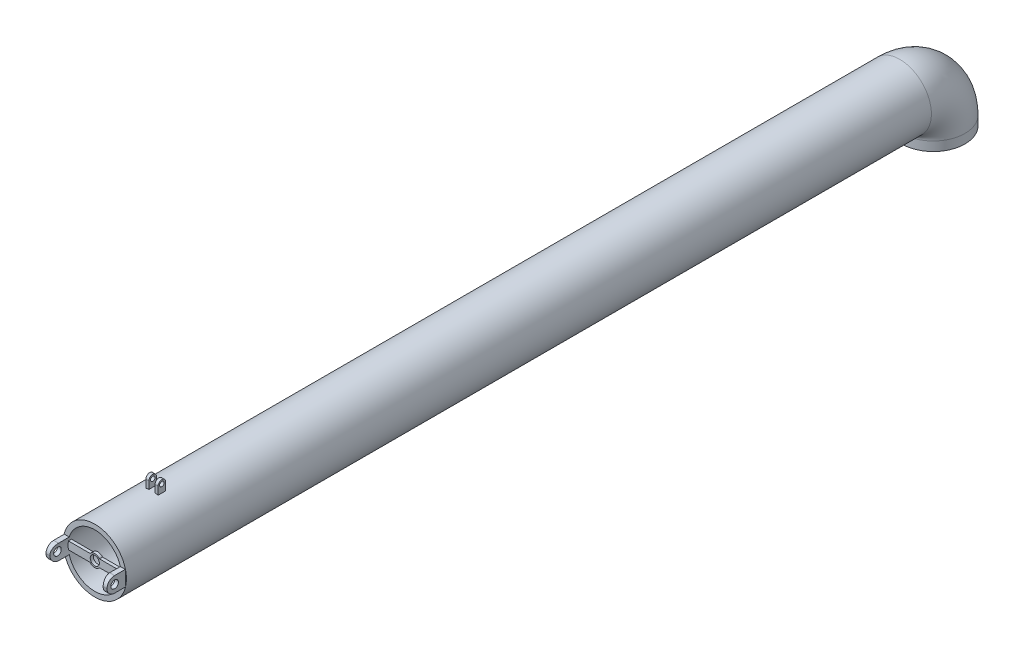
ISO-10303-21;
HEADER;
FILE_DESCRIPTION(('STEP AP214'),'2;1');
FILE_NAME('part.step','',(''),(''),'','','');
FILE_SCHEMA(('AUTOMOTIVE_DESIGN { 1 0 10303 214 1 1 1 1 }'));
ENDSEC;
DATA;
#1=APPLICATION_CONTEXT('core data for automotive mechanical design processes');
#2=APPLICATION_PROTOCOL_DEFINITION('international standard','automotive_design',2000,#1);
#3=PRODUCT_CONTEXT('',#1,'mechanical');
#4=PRODUCT('Part','Part','',(#3));
#5=PRODUCT_RELATED_PRODUCT_CATEGORY('part','',(#4));
#6=PRODUCT_DEFINITION_FORMATION('','',#4);
#7=PRODUCT_DEFINITION_CONTEXT('part definition',#1,'design');
#8=PRODUCT_DEFINITION('design','',#6,#7);
#9=PRODUCT_DEFINITION_SHAPE('','',#8);
#10=(LENGTH_UNIT() NAMED_UNIT(*) SI_UNIT(.MILLI.,.METRE.));
#11=(NAMED_UNIT(*) PLANE_ANGLE_UNIT() SI_UNIT($,.RADIAN.));
#12=(NAMED_UNIT(*) SI_UNIT($,.STERADIAN.) SOLID_ANGLE_UNIT());
#13=UNCERTAINTY_MEASURE_WITH_UNIT(LENGTH_MEASURE(1.E-05),#10,'distance_accuracy_value','');
#14=(GEOMETRIC_REPRESENTATION_CONTEXT(3) GLOBAL_UNCERTAINTY_ASSIGNED_CONTEXT((#13)) GLOBAL_UNIT_ASSIGNED_CONTEXT((#10,
#11,#12)) REPRESENTATION_CONTEXT('',''));
#15=CARTESIAN_POINT('',(0.,0.,0.));
#16=DIRECTION('',(0.,0.,1.));
#17=DIRECTION('',(1.,0.,0.));
#18=AXIS2_PLACEMENT_3D('',#15,#16,#17);
#19=CARTESIAN_POINT('',(0.,280.,220.));
#20=DIRECTION('',(0.,0.,1.));
#21=DIRECTION('',(0.,-1.,0.));
#22=AXIS2_PLACEMENT_3D('',#19,#20,#21);
#23=CYLINDRICAL_SURFACE('',#22,207.5);
#24=CARTESIAN_POINT('',(0.,279.999999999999,5075.));
#25=DIRECTION('',(0.,0.,1.));
#26=DIRECTION('',(1.,0.,0.));
#27=AXIS2_PLACEMENT_3D('',#24,#25,#26);
#28=CIRCLE('',#27,207.5);
#29=CARTESIAN_POINT('',(40.,483.608079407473,5075.));
#30=VERTEX_POINT('',#29);
#31=CARTESIAN_POINT('',(20.,486.533895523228,5075.));
#32=VERTEX_POINT('',#31);
#33=EDGE_CURVE('E89',#30,#32,#28,.T.);
#34=ORIENTED_EDGE('',*,*,#33,.F.);
#35=DIRECTION('',(0.,0.,1.));
#36=VECTOR('',#35,1.);
#37=CARTESIAN_POINT('',(40.,483.608079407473,220.));
#38=LINE('',#37,#36);
#39=CARTESIAN_POINT('',(40.,483.608079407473,5125.));
#40=VERTEX_POINT('',#39);
#41=EDGE_CURVE('E604',#30,#40,#38,.T.);
#42=ORIENTED_EDGE('',*,*,#41,.T.);
#43=CARTESIAN_POINT('',(0.,279.999999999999,5125.));
#44=DIRECTION('',(0.,0.,-1.));
#45=DIRECTION('',(-1.,0.,0.));
#46=AXIS2_PLACEMENT_3D('',#43,#44,#45);
#47=CIRCLE('',#46,207.5);
#48=CARTESIAN_POINT('',(20.,486.533895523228,5125.));
#49=VERTEX_POINT('',#48);
#50=EDGE_CURVE('E594',#49,#40,#47,.T.);
#51=ORIENTED_EDGE('',*,*,#50,.F.);
#52=DIRECTION('',(0.,0.,1.));
#53=VECTOR('',#52,1.);
#54=CARTESIAN_POINT('',(20.,486.533895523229,220.));
#55=LINE('',#54,#53);
#56=EDGE_CURVE('E601',#32,#49,#55,.T.);
#57=ORIENTED_EDGE('',*,*,#56,.F.);
#58=EDGE_LOOP('',(#34,#42,#51,#57));
#59=FACE_BOUND('',#58,.T.);
#60=CARTESIAN_POINT('',(0.,279.999999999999,5500.));
#61=DIRECTION('',(0.,0.,-1.));
#62=DIRECTION('',(0.,1.,0.));
#63=AXIS2_PLACEMENT_3D('',#60,#61,#62);
#64=CIRCLE('',#63,207.5);
#65=CARTESIAN_POINT('',(0.,487.499999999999,5500.));
#66=VERTEX_POINT('',#65);
#67=EDGE_CURVE('E566',#66,#66,#64,.T.);
#68=ORIENTED_EDGE('',*,*,#67,.T.);
#69=EDGE_LOOP('',(#68));
#70=FACE_BOUND('',#69,.T.);
#71=CARTESIAN_POINT('',(0.,280.,220.));
#72=DIRECTION('',(0.,0.,-1.));
#73=DIRECTION('',(0.,1.,0.));
#74=AXIS2_PLACEMENT_3D('',#71,#72,#73);
#75=CIRCLE('',#74,207.5);
#76=CARTESIAN_POINT('',(0.,487.5,220.));
#77=VERTEX_POINT('',#76);
#78=EDGE_CURVE('E564',#77,#77,#75,.T.);
#79=ORIENTED_EDGE('',*,*,#78,.F.);
#80=EDGE_LOOP('',(#79));
#81=FACE_BOUND('',#80,.T.);
#82=DIRECTION('',(0.,0.,1.));
#83=VECTOR('',#82,1.);
#84=CARTESIAN_POINT('',(-40.,483.608079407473,220.));
#85=LINE('',#84,#83);
#86=CARTESIAN_POINT('',(-40.,483.608079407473,5075.));
#87=VERTEX_POINT('',#86);
#88=CARTESIAN_POINT('',(-40.,483.608079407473,5125.));
#89=VERTEX_POINT('',#88);
#90=EDGE_CURVE('E12',#87,#89,#85,.T.);
#91=ORIENTED_EDGE('',*,*,#90,.F.);
#92=CARTESIAN_POINT('',(0.,279.999999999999,5075.));
#93=DIRECTION('',(0.,0.,-1.));
#94=DIRECTION('',(-1.,0.,0.));
#95=AXIS2_PLACEMENT_3D('',#92,#93,#94);
#96=CIRCLE('',#95,207.5);
#97=CARTESIAN_POINT('',(-20.,486.533895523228,5075.));
#98=VERTEX_POINT('',#97);
#99=EDGE_CURVE('E74',#87,#98,#96,.T.);
#100=ORIENTED_EDGE('',*,*,#99,.T.);
#101=DIRECTION('',(0.,0.,1.));
#102=VECTOR('',#101,1.);
#103=CARTESIAN_POINT('',(-20.,486.533895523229,220.));
#104=LINE('',#103,#102);
#105=CARTESIAN_POINT('',(-20.,486.533895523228,5125.));
#106=VERTEX_POINT('',#105);
#107=EDGE_CURVE('E607',#98,#106,#104,.T.);
#108=ORIENTED_EDGE('',*,*,#107,.T.);
#109=CARTESIAN_POINT('',(0.,279.999999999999,5125.));
#110=DIRECTION('',(0.,0.,1.));
#111=DIRECTION('',(1.,0.,0.));
#112=AXIS2_PLACEMENT_3D('',#109,#110,#111);
#113=CIRCLE('',#112,207.5);
#114=EDGE_CURVE('E610',#106,#89,#113,.T.);
#115=ORIENTED_EDGE('',*,*,#114,.T.);
#116=EDGE_LOOP('',(#91,#100,#108,#115));
#117=FACE_BOUND('',#116,.T.);
#118=ADVANCED_FACE('F65',(#59,#70,#81,#117),#23,.T.);
#119=CARTESIAN_POINT('',(0.,280.000000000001,220.));
#120=DIRECTION('',(0.,0.,1.));
#121=DIRECTION('',(0.,-1.,0.));
#122=AXIS2_PLACEMENT_3D('',#119,#120,#121);
#123=CYLINDRICAL_SURFACE('',#122,175.);
#124=CARTESIAN_POINT('',(-175.,280.000000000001,5545.));
#125=CARTESIAN_POINT('',(-175.000003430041,280.698559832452,5544.99999094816));
#126=CARTESIAN_POINT('',(-174.995809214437,281.396991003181,5545.02928908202));
#127=CARTESIAN_POINT('',(-174.979156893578,282.789068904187,5545.14625003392));
#128=CARTESIAN_POINT('',(-174.966697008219,283.482714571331,5545.23392542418));
#129=CARTESIAN_POINT('',(-174.933843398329,284.860655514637,5545.4671072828));
#130=CARTESIAN_POINT('',(-174.913442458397,285.544941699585,5545.61266634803));
#131=CARTESIAN_POINT('',(-174.865283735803,286.898639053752,5545.96050949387));
#132=CARTESIAN_POINT('',(-174.837526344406,287.568051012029,5546.16279055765));
#133=CARTESIAN_POINT('',(-174.775454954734,288.886836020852,5546.62241628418));
#134=CARTESIAN_POINT('',(-174.741145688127,289.536223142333,5546.87972122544));
#135=CARTESIAN_POINT('',(-174.666915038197,290.810941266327,5547.44760750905));
#136=CARTESIAN_POINT('',(-174.626993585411,291.436271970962,5547.75818951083));
#137=CARTESIAN_POINT('',(-174.542656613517,292.65844487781,5548.43034372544));
#138=CARTESIAN_POINT('',(-174.498241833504,293.255291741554,5548.79190755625));
#139=CARTESIAN_POINT('',(-174.406145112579,294.416512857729,5549.56351020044));
#140=CARTESIAN_POINT('',(-174.358463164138,294.980887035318,5549.97354912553));
#141=CARTESIAN_POINT('',(-174.260843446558,296.076786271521,5550.84200308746));
#142=CARTESIAN_POINT('',(-174.210893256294,296.608079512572,5551.30070928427));
#143=CARTESIAN_POINT('',(-174.110423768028,297.630204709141,5552.26112537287));
#144=CARTESIAN_POINT('',(-174.05990446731,298.121036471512,5552.76283546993));
#145=CARTESIAN_POINT('',(-173.959714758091,299.058859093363,5553.80581149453));
#146=CARTESIAN_POINT('',(-173.910044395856,299.505847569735,5554.34707956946));
#147=CARTESIAN_POINT('',(-173.812957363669,300.352828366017,5555.46540723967));
#148=CARTESIAN_POINT('',(-173.765540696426,300.752820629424,5556.04246687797));
#149=CARTESIAN_POINT('',(-173.674102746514,301.504654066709,5557.23103237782));
#150=CARTESIAN_POINT('',(-173.630097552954,301.856272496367,5557.84268041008));
#151=CARTESIAN_POINT('',(-173.546986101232,302.506691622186,5559.093767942));
#152=CARTESIAN_POINT('',(-173.5078798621,302.805492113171,5559.73320754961));
#153=CARTESIAN_POINT('',(-173.435702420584,303.348063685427,5561.03532638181));
#154=CARTESIAN_POINT('',(-173.402630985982,303.591836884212,5561.69800471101));
#155=CARTESIAN_POINT('',(-173.343487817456,304.02254219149,5563.041886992));
#156=CARTESIAN_POINT('',(-173.317416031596,304.20947472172,5563.72309080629));
#157=CARTESIAN_POINT('',(-173.273189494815,304.524006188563,5565.09442908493));
#158=CARTESIAN_POINT('',(-173.254982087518,304.652000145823,5565.78447125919));
#159=CARTESIAN_POINT('',(-173.226758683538,304.849548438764,5567.17303715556));
#160=CARTESIAN_POINT('',(-173.216742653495,304.919103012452,5567.87156084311));
#161=CARTESIAN_POINT('',(-173.205195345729,304.99923903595,5569.2720205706));
#162=CARTESIAN_POINT('',(-173.203663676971,305.009823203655,5569.97395645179));
#163=CARTESIAN_POINT('',(-173.209128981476,304.971944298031,5571.37619813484));
#164=CARTESIAN_POINT('',(-173.21612592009,304.923481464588,5572.07650394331));
#165=CARTESIAN_POINT('',(-173.2383592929,304.768466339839,5573.4651881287));
#166=CARTESIAN_POINT('',(-173.253533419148,304.662353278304,5574.15361658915));
#167=CARTESIAN_POINT('',(-173.291643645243,304.393128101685,5575.51901214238));
#168=CARTESIAN_POINT('',(-173.314579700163,304.230016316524,5576.19597930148));
#169=CARTESIAN_POINT('',(-173.367557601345,303.848000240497,5577.5337083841));
#170=CARTESIAN_POINT('',(-173.397599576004,303.629094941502,5578.19447001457));
#171=CARTESIAN_POINT('',(-173.463934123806,303.137094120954,5579.4951755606));
#172=CARTESIAN_POINT('',(-173.500226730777,302.863998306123,5580.13511936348));
#173=CARTESIAN_POINT('',(-173.578175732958,302.264513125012,5581.39201379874));
#174=CARTESIAN_POINT('',(-173.619850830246,301.937936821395,5582.0088741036));
#175=CARTESIAN_POINT('',(-173.707284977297,301.23451656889,5583.21292734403));
#176=CARTESIAN_POINT('',(-173.753044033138,300.857672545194,5583.80012023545));
#177=CARTESIAN_POINT('',(-173.847363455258,300.056343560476,5584.94084853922));
#178=CARTESIAN_POINT('',(-173.895923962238,299.631856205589,5585.4943822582));
#179=CARTESIAN_POINT('',(-173.994488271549,298.738198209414,5586.56398520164));
#180=CARTESIAN_POINT('',(-174.044492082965,298.269027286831,5587.08005419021));
#181=CARTESIAN_POINT('',(-174.145006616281,297.284777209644,5588.07569961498));
#182=CARTESIAN_POINT('',(-174.195517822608,296.769320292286,5588.55490264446));
#183=CARTESIAN_POINT('',(-174.2951678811,295.699772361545,5589.4682221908));
#184=CARTESIAN_POINT('',(-174.344306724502,295.145681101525,5589.90233841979));
#185=CARTESIAN_POINT('',(-174.439825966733,294.002711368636,5590.72242270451));
#186=CARTESIAN_POINT('',(-174.486206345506,293.413832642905,5591.1083904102));
#187=CARTESIAN_POINT('',(-174.57489867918,292.205397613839,5591.82941392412));
#188=CARTESIAN_POINT('',(-174.61721064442,291.585841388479,5592.16446986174));
#189=CARTESIAN_POINT('',(-174.696589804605,290.320066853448,5592.78139962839));
#190=CARTESIAN_POINT('',(-174.733654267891,289.673834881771,5593.06324578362));
#191=CARTESIAN_POINT('',(-174.801459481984,288.359585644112,5593.5714595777));
#192=CARTESIAN_POINT('',(-174.832200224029,287.691568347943,5593.79782713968));
#193=CARTESIAN_POINT('',(-174.886480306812,286.338559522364,5594.19337530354));
#194=CARTESIAN_POINT('',(-174.910020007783,285.653568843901,5594.3625587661));
#195=CARTESIAN_POINT('',(-174.949226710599,284.271524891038,5594.64246663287));
#196=CARTESIAN_POINT('',(-174.964893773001,283.574471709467,5594.75319148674));
#197=CARTESIAN_POINT('',(-174.987806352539,282.179458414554,5594.91462833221));
#198=CARTESIAN_POINT('',(-174.995123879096,281.481558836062,5594.96585354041));
#199=CARTESIAN_POINT('',(-175.001375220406,280.083886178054,5595.00963427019));
#200=CARTESIAN_POINT('',(-175.000309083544,279.384113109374,5595.00219013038));
#201=CARTESIAN_POINT('',(-174.989823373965,277.987734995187,5594.92869027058));
#202=CARTESIAN_POINT('',(-174.980404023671,277.291129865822,5594.8626361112));
#203=CARTESIAN_POINT('',(-174.953477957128,275.906058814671,5594.6724197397));
#204=CARTESIAN_POINT('',(-174.935971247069,275.217592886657,5594.54825757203));
#205=CARTESIAN_POINT('',(-174.893456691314,273.856687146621,5594.24342873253));
#206=CARTESIAN_POINT('',(-174.868481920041,273.184190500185,5594.06301105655));
#207=CARTESIAN_POINT('',(-174.811699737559,271.856847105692,5593.64683534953));
#208=CARTESIAN_POINT('',(-174.779892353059,271.202000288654,5593.41107753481));
#209=CARTESIAN_POINT('',(-174.710326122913,269.91448335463,5592.88592895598));
#210=CARTESIAN_POINT('',(-174.672567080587,269.281813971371,5592.59653641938));
#211=CARTESIAN_POINT('',(-174.592142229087,268.043027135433,5591.96619654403));
#212=CARTESIAN_POINT('',(-174.549476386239,267.436909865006,5591.62524885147));
#213=CARTESIAN_POINT('',(-174.460118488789,266.251444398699,5590.89177503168));
#214=CARTESIAN_POINT('',(-174.413401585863,265.672300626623,5590.49892151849));
#215=CARTESIAN_POINT('',(-174.317490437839,264.549100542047,5589.66617591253));
#216=CARTESIAN_POINT('',(-174.268296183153,264.005044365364,5589.2262836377));
#217=CARTESIAN_POINT('',(-174.168799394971,262.955730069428,5588.30249963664));
#218=CARTESIAN_POINT('',(-174.118496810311,262.450473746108,5587.81860587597));
#219=CARTESIAN_POINT('',(-174.018189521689,261.482260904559,5586.81017363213));
#220=CARTESIAN_POINT('',(-173.968184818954,261.019304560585,5586.28563498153));
#221=CARTESIAN_POINT('',(-173.869503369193,260.135583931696,5585.19542820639));
#222=CARTESIAN_POINT('',(-173.820839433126,259.715163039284,5584.62948049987));
#223=CARTESIAN_POINT('',(-173.726624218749,258.923496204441,5583.46392603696));
#224=CARTESIAN_POINT('',(-173.681072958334,258.552250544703,5582.8643190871));
#225=CARTESIAN_POINT('',(-173.59439224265,257.861613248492,5581.63565500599));
#226=CARTESIAN_POINT('',(-173.553262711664,257.542220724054,5581.0065983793));
#227=CARTESIAN_POINT('',(-173.476614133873,256.957619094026,5579.72346248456));
#228=CARTESIAN_POINT('',(-173.44109505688,256.692409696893,5579.06938335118));
#229=CARTESIAN_POINT('',(-173.376807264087,256.218922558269,5577.74303394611));
#230=CARTESIAN_POINT('',(-173.348016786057,256.010460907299,5577.07083038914));
#231=CARTESIAN_POINT('',(-173.297875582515,255.65088681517,5575.71098074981));
#232=CARTESIAN_POINT('',(-173.276524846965,255.499774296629,5575.0233346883));
#233=CARTESIAN_POINT('',(-173.24188960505,255.25605401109,5573.63758641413));
#234=CARTESIAN_POINT('',(-173.228604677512,255.163443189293,5572.9394847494));
#235=CARTESIAN_POINT('',(-173.210490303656,255.03742560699,5571.53785054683));
#236=CARTESIAN_POINT('',(-173.205660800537,255.004018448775,5570.83431804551));
#237=CARTESIAN_POINT('',(-173.204604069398,254.996697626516,5569.43335328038));
#238=CARTESIAN_POINT('',(-173.208298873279,255.022244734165,5568.73592383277));
#239=CARTESIAN_POINT('',(-173.224022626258,255.131525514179,5567.34573729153));
#240=CARTESIAN_POINT('',(-173.236051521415,255.215258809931,5566.65298016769));
#241=CARTESIAN_POINT('',(-173.268095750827,255.440279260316,5565.27707083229));
#242=CARTESIAN_POINT('',(-173.28811104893,255.581566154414,5564.59391857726));
#243=CARTESIAN_POINT('',(-173.335551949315,255.920637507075,5563.24204630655));
#244=CARTESIAN_POINT('',(-173.362977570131,256.118422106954,5562.57332632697));
#245=CARTESIAN_POINT('',(-173.424434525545,256.568886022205,5561.2554279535));
#246=CARTESIAN_POINT('',(-173.458461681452,256.821530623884,5560.60623749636));
#247=CARTESIAN_POINT('',(-173.532166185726,257.379952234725,5559.33146384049));
#248=CARTESIAN_POINT('',(-173.571843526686,257.685729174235,5558.7058806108));
#249=CARTESIAN_POINT('',(-173.65573011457,258.348237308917,5557.48261173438));
#250=CARTESIAN_POINT('',(-173.699939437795,258.704969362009,5556.88492655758));
#251=CARTESIAN_POINT('',(-173.791651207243,259.46687706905,5555.72154192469));
#252=CARTESIAN_POINT('',(-173.839153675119,259.872053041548,5555.15584267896));
#253=CARTESIAN_POINT('',(-173.936552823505,260.731779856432,5554.05548969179));
#254=CARTESIAN_POINT('',(-173.986466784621,261.186730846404,5553.52115007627));
#255=CARTESIAN_POINT('',(-174.08689311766,262.139898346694,5552.49261927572));
#256=CARTESIAN_POINT('',(-174.137405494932,262.638115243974,5551.99842844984));
#257=CARTESIAN_POINT('',(-174.237621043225,263.67448526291,5551.05351185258));
#258=CARTESIAN_POINT('',(-174.2873240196,264.212647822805,5550.60279641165));
#259=CARTESIAN_POINT('',(-174.384512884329,265.32507796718,5549.74811974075));
#260=CARTESIAN_POINT('',(-174.43199879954,265.899345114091,5549.34415794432));
#261=CARTESIAN_POINT('',(-174.523648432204,267.082951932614,5548.58395430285));
#262=CARTESIAN_POINT('',(-174.567794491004,267.692451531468,5548.22795925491));
#263=CARTESIAN_POINT('',(-174.651250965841,268.939658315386,5547.56862787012));
#264=CARTESIAN_POINT('',(-174.690561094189,269.577367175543,5547.26529466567));
#265=CARTESIAN_POINT('',(-174.76318817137,270.875839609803,5546.71380925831));
#266=CARTESIAN_POINT('',(-174.796510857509,271.536580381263,5546.46560417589));
#267=CARTESIAN_POINT('',(-174.856253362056,272.876743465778,5546.0259173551));
#268=CARTESIAN_POINT('',(-174.882674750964,273.556161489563,5545.83442271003));
#269=CARTESIAN_POINT('',(-174.936265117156,275.184457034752,5545.44910392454));
#270=CARTESIAN_POINT('',(-174.960061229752,276.139619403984,5545.28087350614));
#271=CARTESIAN_POINT('',(-174.991926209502,278.06327033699,5545.05632841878));
#272=CARTESIAN_POINT('',(-174.99999524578,279.031758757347,5545.00001254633));
#273=CARTESIAN_POINT('',(-175.,280.000000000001,5545.));
#274=B_SPLINE_CURVE_WITH_KNOTS('',3,(#124,#125,#126,#127,#128,#129,#130,#131,#132,#133,#134,
#135,#136,#137,#138,#139,#140,#141,#142,#143,#144,#145,#146,#147,#148,#149,#150,#151,#152,#153,
#154,#155,#156,#157,#158,#159,#160,#161,#162,#163,#164,#165,#166,#167,#168,#169,#170,#171,#172,
#173,#174,#175,#176,#177,#178,#179,#180,#181,#182,#183,#184,#185,#186,#187,#188,#189,#190,#191,
#192,#193,#194,#195,#196,#197,#198,#199,#200,#201,#202,#203,#204,#205,#206,#207,#208,#209,#210,
#211,#212,#213,#214,#215,#216,#217,#218,#219,#220,#221,#222,#223,#224,#225,#226,#227,#228,#229,
#230,#231,#232,#233,#234,#235,#236,#237,#238,#239,#240,#241,#242,#243,#244,#245,#246,#247,#248,
#249,#250,#251,#252,#253,#254,#255,#256,#257,#258,#259,#260,#261,#262,#263,#264,#265,#266,#267,
#268,#269,#270,#271,#272,#273),.UNSPECIFIED.,.T.,.F.,(4,2,2,2,2,2,2,2,2,2,2,2,2,2,2,2,2,2,2,2,2,
2,2,2,2,2,2,2,2,2,2,2,2,2,2,2,2,2,2,2,2,2,2,2,2,2,2,2,2,2,2,2,2,2,2,2,2,2,2,2,2,2,2,2,2,2,2,2,2,
2,2,2,2,2,4),(0.,2.09483164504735,4.19011458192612,6.28730579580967,8.38438548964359,
10.4799563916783,12.5755532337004,14.6708059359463,16.7660634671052,18.8746504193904,
20.9832474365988,23.0919590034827,25.2006731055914,27.3187934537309,29.4369220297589,
31.5549690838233,33.673000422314,35.7766218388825,37.8802346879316,39.9837505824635,
42.0872579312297,44.1749591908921,46.2626483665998,48.3503752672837,50.4381134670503,
52.5333113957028,54.6285124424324,56.7238188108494,58.8191383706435,60.9334608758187,
63.0477968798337,65.1621482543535,67.2764942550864,69.3919368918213,71.5073824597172,
73.6227221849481,75.7380456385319,77.8349845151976,79.9319112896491,82.0287822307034,
84.1256515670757,86.2133685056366,88.3010772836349,90.3888550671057,92.4766471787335,
94.5782994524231,96.6799598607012,98.7817174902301,100.883483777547,103.001052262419,
105.118632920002,107.236177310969,109.353710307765,111.464296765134,113.574880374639,
115.685353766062,117.795812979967,119.88704536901,121.97826422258,124.069473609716,
126.160688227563,128.250583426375,130.340475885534,132.430403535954,134.520344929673,
136.628530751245,138.736735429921,140.84543982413,142.954118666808,145.07326340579,
147.192534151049,149.309763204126,151.426510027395,154.330089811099,157.233638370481),.UNSPECIFIED.);
#275=CARTESIAN_POINT('',(-175.,280.000000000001,5545.));
#276=VERTEX_POINT('',#275);
#277=EDGE_CURVE('E379',#276,#276,#274,.T.);
#278=ORIENTED_EDGE('',*,*,#277,.F.);
#279=EDGE_LOOP('',(#278));
#280=FACE_BOUND('',#279,.T.);
#281=CARTESIAN_POINT('',(175.,280.000000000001,5545.));
#282=CARTESIAN_POINT('',(175.000003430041,279.301440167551,5544.99999094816));
#283=CARTESIAN_POINT('',(174.995809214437,278.603008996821,5545.02928908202));
#284=CARTESIAN_POINT('',(174.979156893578,277.210931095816,5545.14625003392));
#285=CARTESIAN_POINT('',(174.966697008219,276.517285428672,5545.23392542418));
#286=CARTESIAN_POINT('',(174.933843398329,275.139344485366,5545.4671072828));
#287=CARTESIAN_POINT('',(174.913442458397,274.455058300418,5545.61266634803));
#288=CARTESIAN_POINT('',(174.865283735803,273.101360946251,5545.96050949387));
#289=CARTESIAN_POINT('',(174.837526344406,272.431948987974,5546.16279055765));
#290=CARTESIAN_POINT('',(174.775454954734,271.113163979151,5546.62241628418));
#291=CARTESIAN_POINT('',(174.741145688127,270.46377685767,5546.87972122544));
#292=CARTESIAN_POINT('',(174.666915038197,269.189058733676,5547.44760750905));
#293=CARTESIAN_POINT('',(174.626993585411,268.563728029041,5547.75818951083));
#294=CARTESIAN_POINT('',(174.542656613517,267.341555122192,5548.43034372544));
#295=CARTESIAN_POINT('',(174.498241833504,266.744708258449,5548.79190755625));
#296=CARTESIAN_POINT('',(174.406145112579,265.583487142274,5549.56351020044));
#297=CARTESIAN_POINT('',(174.358463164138,265.019112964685,5549.97354912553));
#298=CARTESIAN_POINT('',(174.260843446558,263.923213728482,5550.84200308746));
#299=CARTESIAN_POINT('',(174.210893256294,263.39192048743,5551.30070928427));
#300=CARTESIAN_POINT('',(174.110423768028,262.369795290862,5552.26112537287));
#301=CARTESIAN_POINT('',(174.05990446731,261.878963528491,5552.76283546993));
#302=CARTESIAN_POINT('',(173.959714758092,260.94114090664,5553.80581149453));
#303=CARTESIAN_POINT('',(173.910044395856,260.494152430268,5554.34707956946));
#304=CARTESIAN_POINT('',(173.812957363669,259.647171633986,5555.46540723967));
#305=CARTESIAN_POINT('',(173.765540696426,259.247179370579,5556.04246687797));
#306=CARTESIAN_POINT('',(173.674102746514,258.495345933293,5557.23103237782));
#307=CARTESIAN_POINT('',(173.630097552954,258.143727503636,5557.84268041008));
#308=CARTESIAN_POINT('',(173.546986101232,257.493308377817,5559.093767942));
#309=CARTESIAN_POINT('',(173.5078798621,257.194507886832,5559.73320754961));
#310=CARTESIAN_POINT('',(173.435702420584,256.651936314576,5561.03532638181));
#311=CARTESIAN_POINT('',(173.402630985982,256.408163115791,5561.69800471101));
#312=CARTESIAN_POINT('',(173.343487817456,255.977457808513,5563.041886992));
#313=CARTESIAN_POINT('',(173.317416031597,255.790525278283,5563.72309080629));
#314=CARTESIAN_POINT('',(173.273189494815,255.47599381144,5565.09442908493));
#315=CARTESIAN_POINT('',(173.254982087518,255.34799985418,5565.78447125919));
#316=CARTESIAN_POINT('',(173.226758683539,255.150451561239,5567.17303715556));
#317=CARTESIAN_POINT('',(173.216742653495,255.080896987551,5567.87156084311));
#318=CARTESIAN_POINT('',(173.20519534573,255.000760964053,5569.2720205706));
#319=CARTESIAN_POINT('',(173.203663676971,254.990176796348,5569.97395645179));
#320=CARTESIAN_POINT('',(173.209128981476,255.028055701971,5571.37619813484));
#321=CARTESIAN_POINT('',(173.216125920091,255.076518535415,5572.07650394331));
#322=CARTESIAN_POINT('',(173.2383592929,255.231533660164,5573.4651881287));
#323=CARTESIAN_POINT('',(173.253533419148,255.337646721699,5574.15361658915));
#324=CARTESIAN_POINT('',(173.291643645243,255.606871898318,5575.51901214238));
#325=CARTESIAN_POINT('',(173.314579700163,255.769983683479,5576.19597930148));
#326=CARTESIAN_POINT('',(173.367557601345,256.151999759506,5577.5337083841));
#327=CARTESIAN_POINT('',(173.397599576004,256.370905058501,5578.19447001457));
#328=CARTESIAN_POINT('',(173.463934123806,256.862905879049,5579.4951755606));
#329=CARTESIAN_POINT('',(173.500226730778,257.13600169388,5580.13511936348));
#330=CARTESIAN_POINT('',(173.578175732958,257.735486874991,5581.39201379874));
#331=CARTESIAN_POINT('',(173.619850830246,258.062063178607,5582.0088741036));
#332=CARTESIAN_POINT('',(173.707284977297,258.765483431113,5583.21292734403));
#333=CARTESIAN_POINT('',(173.753044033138,259.142327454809,5583.80012023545));
#334=CARTESIAN_POINT('',(173.847363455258,259.943656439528,5584.94084853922));
#335=CARTESIAN_POINT('',(173.895923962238,260.368143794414,5585.4943822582));
#336=CARTESIAN_POINT('',(173.994488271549,261.261801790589,5586.56398520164));
#337=CARTESIAN_POINT('',(174.044492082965,261.730972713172,5587.08005419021));
#338=CARTESIAN_POINT('',(174.145006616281,262.715222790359,5588.07569961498));
#339=CARTESIAN_POINT('',(174.195517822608,263.230679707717,5588.55490264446));
#340=CARTESIAN_POINT('',(174.2951678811,264.300227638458,5589.4682221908));
#341=CARTESIAN_POINT('',(174.344306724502,264.854318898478,5589.90233841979));
#342=CARTESIAN_POINT('',(174.439825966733,265.997288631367,5590.72242270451));
#343=CARTESIAN_POINT('',(174.486206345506,266.586167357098,5591.1083904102));
#344=CARTESIAN_POINT('',(174.57489867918,267.794602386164,5591.82941392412));
#345=CARTESIAN_POINT('',(174.61721064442,268.414158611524,5592.16446986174));
#346=CARTESIAN_POINT('',(174.696589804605,269.679933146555,5592.78139962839));
#347=CARTESIAN_POINT('',(174.733654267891,270.326165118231,5593.06324578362));
#348=CARTESIAN_POINT('',(174.801459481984,271.640414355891,5593.5714595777));
#349=CARTESIAN_POINT('',(174.832200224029,272.308431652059,5593.79782713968));
#350=CARTESIAN_POINT('',(174.886480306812,273.661440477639,5594.19337530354));
#351=CARTESIAN_POINT('',(174.910020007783,274.346431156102,5594.3625587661));
#352=CARTESIAN_POINT('',(174.949226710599,275.728475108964,5594.64246663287));
#353=CARTESIAN_POINT('',(174.964893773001,276.425528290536,5594.75319148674));
#354=CARTESIAN_POINT('',(174.987806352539,277.820541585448,5594.91462833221));
#355=CARTESIAN_POINT('',(174.995123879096,278.518441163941,5594.96585354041));
#356=CARTESIAN_POINT('',(175.001375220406,279.916113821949,5595.00963427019));
#357=CARTESIAN_POINT('',(175.000309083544,280.615886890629,5595.00219013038));
#358=CARTESIAN_POINT('',(174.989823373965,282.012265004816,5594.92869027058));
#359=CARTESIAN_POINT('',(174.980404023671,282.708870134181,5594.8626361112));
#360=CARTESIAN_POINT('',(174.953477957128,284.093941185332,5594.67241973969));
#361=CARTESIAN_POINT('',(174.935971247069,284.782407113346,5594.54825757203));
#362=CARTESIAN_POINT('',(174.893456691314,286.143312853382,5594.24342873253));
#363=CARTESIAN_POINT('',(174.86848192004,286.815809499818,5594.06301105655));
#364=CARTESIAN_POINT('',(174.811699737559,288.143152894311,5593.64683534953));
#365=CARTESIAN_POINT('',(174.779892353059,288.79799971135,5593.41107753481));
#366=CARTESIAN_POINT('',(174.710326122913,290.085516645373,5592.88592895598));
#367=CARTESIAN_POINT('',(174.672567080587,290.718186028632,5592.59653641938));
#368=CARTESIAN_POINT('',(174.592142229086,291.95697286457,5591.96619654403));
#369=CARTESIAN_POINT('',(174.549476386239,292.563090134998,5591.62524885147));
#370=CARTESIAN_POINT('',(174.460118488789,293.748555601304,5590.89177503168));
#371=CARTESIAN_POINT('',(174.413401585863,294.32769937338,5590.49892151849));
#372=CARTESIAN_POINT('',(174.317490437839,295.450899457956,5589.66617591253));
#373=CARTESIAN_POINT('',(174.268296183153,295.994955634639,5589.2262836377));
#374=CARTESIAN_POINT('',(174.168799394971,297.044269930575,5588.30249963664));
#375=CARTESIAN_POINT('',(174.118496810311,297.549526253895,5587.81860587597));
#376=CARTESIAN_POINT('',(174.018189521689,298.517739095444,5586.81017363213));
#377=CARTESIAN_POINT('',(173.968184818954,298.980695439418,5586.28563498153));
#378=CARTESIAN_POINT('',(173.869503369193,299.864416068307,5585.19542820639));
#379=CARTESIAN_POINT('',(173.820839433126,300.284836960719,5584.62948049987));
#380=CARTESIAN_POINT('',(173.726624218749,301.076503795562,5583.46392603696));
#381=CARTESIAN_POINT('',(173.681072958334,301.4477494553,5582.8643190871));
#382=CARTESIAN_POINT('',(173.594392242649,302.138386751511,5581.63565500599));
#383=CARTESIAN_POINT('',(173.553262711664,302.457779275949,5581.0065983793));
#384=CARTESIAN_POINT('',(173.476614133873,303.042380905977,5579.72346248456));
#385=CARTESIAN_POINT('',(173.44109505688,303.30759030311,5579.06938335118));
#386=CARTESIAN_POINT('',(173.376807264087,303.781077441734,5577.74303394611));
#387=CARTESIAN_POINT('',(173.348016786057,303.989539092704,5577.07083038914));
#388=CARTESIAN_POINT('',(173.297875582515,304.349113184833,5575.71098074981));
#389=CARTESIAN_POINT('',(173.276524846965,304.500225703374,5575.02333468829));
#390=CARTESIAN_POINT('',(173.24188960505,304.743945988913,5573.63758641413));
#391=CARTESIAN_POINT('',(173.228604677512,304.836556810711,5572.93948474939));
#392=CARTESIAN_POINT('',(173.210490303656,304.962574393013,5571.53785054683));
#393=CARTESIAN_POINT('',(173.205660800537,304.995981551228,5570.83431804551));
#394=CARTESIAN_POINT('',(173.204604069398,305.003302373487,5569.43335328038));
#395=CARTESIAN_POINT('',(173.208298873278,304.977755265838,5568.73592383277));
#396=CARTESIAN_POINT('',(173.224022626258,304.868474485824,5567.34573729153));
#397=CARTESIAN_POINT('',(173.236051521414,304.784741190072,5566.65298016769));
#398=CARTESIAN_POINT('',(173.268095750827,304.559720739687,5565.27707083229));
#399=CARTESIAN_POINT('',(173.28811104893,304.418433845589,5564.59391857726));
#400=CARTESIAN_POINT('',(173.335551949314,304.079362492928,5563.24204630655));
#401=CARTESIAN_POINT('',(173.362977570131,303.881577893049,5562.57332632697));
#402=CARTESIAN_POINT('',(173.424434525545,303.431113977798,5561.2554279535));
#403=CARTESIAN_POINT('',(173.458461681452,303.178469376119,5560.60623749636));
#404=CARTESIAN_POINT('',(173.532166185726,302.620047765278,5559.33146384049));
#405=CARTESIAN_POINT('',(173.571843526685,302.314270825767,5558.7058806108));
#406=CARTESIAN_POINT('',(173.655730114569,301.651762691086,5557.48261173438));
#407=CARTESIAN_POINT('',(173.699939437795,301.295030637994,5556.88492655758));
#408=CARTESIAN_POINT('',(173.791651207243,300.533122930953,5555.72154192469));
#409=CARTESIAN_POINT('',(173.839153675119,300.127946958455,5555.15584267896));
#410=CARTESIAN_POINT('',(173.936552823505,299.268220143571,5554.05548969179));
#411=CARTESIAN_POINT('',(173.986466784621,298.813269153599,5553.52115007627));
#412=CARTESIAN_POINT('',(174.08689311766,297.860101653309,5552.49261927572));
#413=CARTESIAN_POINT('',(174.137405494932,297.361884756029,5551.99842844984));
#414=CARTESIAN_POINT('',(174.237621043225,296.325514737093,5551.05351185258));
#415=CARTESIAN_POINT('',(174.2873240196,295.787352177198,5550.60279641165));
#416=CARTESIAN_POINT('',(174.384512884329,294.674922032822,5549.74811974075));
#417=CARTESIAN_POINT('',(174.43199879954,294.100654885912,5549.34415794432));
#418=CARTESIAN_POINT('',(174.523648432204,292.917048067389,5548.58395430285));
#419=CARTESIAN_POINT('',(174.567794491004,292.307548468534,5548.22795925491));
#420=CARTESIAN_POINT('',(174.651250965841,291.060341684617,5547.56862787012));
#421=CARTESIAN_POINT('',(174.690561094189,290.42263282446,5547.26529466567));
#422=CARTESIAN_POINT('',(174.76318817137,289.1241603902,5546.71380925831));
#423=CARTESIAN_POINT('',(174.796510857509,288.46341961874,5546.46560417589));
#424=CARTESIAN_POINT('',(174.856253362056,287.123256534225,5546.0259173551));
#425=CARTESIAN_POINT('',(174.882674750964,286.44383851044,5545.83442271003));
#426=CARTESIAN_POINT('',(174.936265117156,284.815542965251,5545.44910392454));
#427=CARTESIAN_POINT('',(174.960061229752,283.860380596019,5545.28087350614));
#428=CARTESIAN_POINT('',(174.991926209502,281.936729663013,5545.05632841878));
#429=CARTESIAN_POINT('',(174.99999524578,280.968241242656,5545.00001254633));
#430=CARTESIAN_POINT('',(175.,280.000000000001,5545.));
#431=B_SPLINE_CURVE_WITH_KNOTS('',3,(#281,#282,#283,#284,#285,#286,#287,#288,#289,#290,#291,
#292,#293,#294,#295,#296,#297,#298,#299,#300,#301,#302,#303,#304,#305,#306,#307,#308,#309,#310,
#311,#312,#313,#314,#315,#316,#317,#318,#319,#320,#321,#322,#323,#324,#325,#326,#327,#328,#329,
#330,#331,#332,#333,#334,#335,#336,#337,#338,#339,#340,#341,#342,#343,#344,#345,#346,#347,#348,
#349,#350,#351,#352,#353,#354,#355,#356,#357,#358,#359,#360,#361,#362,#363,#364,#365,#366,#367,
#368,#369,#370,#371,#372,#373,#374,#375,#376,#377,#378,#379,#380,#381,#382,#383,#384,#385,#386,
#387,#388,#389,#390,#391,#392,#393,#394,#395,#396,#397,#398,#399,#400,#401,#402,#403,#404,#405,
#406,#407,#408,#409,#410,#411,#412,#413,#414,#415,#416,#417,#418,#419,#420,#421,#422,#423,#424,
#425,#426,#427,#428,#429,#430),.UNSPECIFIED.,.T.,.F.,(4,2,2,2,2,2,2,2,2,2,2,2,2,2,2,2,2,2,2,2,2,
2,2,2,2,2,2,2,2,2,2,2,2,2,2,2,2,2,2,2,2,2,2,2,2,2,2,2,2,2,2,2,2,2,2,2,2,2,2,2,2,2,2,2,2,2,2,2,2,
2,2,2,2,2,4),(0.,2.09483164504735,4.19011458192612,6.28730579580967,8.38438548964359,
10.4799563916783,12.5755532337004,14.6708059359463,16.7660634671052,18.8746504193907,
20.9832474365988,23.0919590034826,25.2006731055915,27.318793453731,29.4369220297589,
31.5549690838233,33.673000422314,35.7766218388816,37.8802346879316,39.9837505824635,
42.0872579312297,44.1749591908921,46.2626483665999,48.3503752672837,50.4381134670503,
52.5333113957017,54.6285124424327,56.7238188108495,58.8191383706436,60.9334608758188,
63.0477968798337,65.1621482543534,67.2764942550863,69.3919368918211,71.5073824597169,
73.6227221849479,75.7380456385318,77.8349845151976,79.931911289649,82.0287822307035,
84.1256515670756,86.2133685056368,88.3010772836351,90.3888550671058,92.4766471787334,
94.5782994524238,96.6799598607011,98.78171749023,100.883483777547,103.001052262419,
105.118632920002,107.236177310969,109.353710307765,111.464296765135,113.57488037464,
115.685353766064,117.795812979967,119.88704536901,121.97826422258,124.069473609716,
126.160688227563,128.250583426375,130.340475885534,132.430403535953,134.520344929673,
136.628530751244,138.736735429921,140.845439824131,142.954118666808,145.07326340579,
147.192534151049,149.309763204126,151.426510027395,154.330089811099,157.233638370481),.UNSPECIFIED.);
#432=CARTESIAN_POINT('',(175.,280.000000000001,5545.));
#433=VERTEX_POINT('',#432);
#434=EDGE_CURVE('E371',#433,#433,#431,.T.);
#435=ORIENTED_EDGE('',*,*,#434,.F.);
#436=EDGE_LOOP('',(#435));
#437=FACE_BOUND('',#436,.T.);
#438=DIRECTION('',(0.,0.,-1.));
#439=VECTOR('',#438,1.);
#440=CARTESIAN_POINT('',(167.705098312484,230.000000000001,5620.));
#441=LINE('',#440,#439);
#442=CARTESIAN_POINT('',(167.705098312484,230.000000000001,5570.));
#443=VERTEX_POINT('',#442);
#444=CARTESIAN_POINT('',(167.705098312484,230.000000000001,5500.));
#445=VERTEX_POINT('',#444);
#446=EDGE_CURVE('E505',#443,#445,#441,.T.);
#447=ORIENTED_EDGE('',*,*,#446,.F.);
#448=CARTESIAN_POINT('',(167.705098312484,230.000000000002,5570.));
#449=CARTESIAN_POINT('',(167.705086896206,229.999989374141,5570.68773200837));
#450=CARTESIAN_POINT('',(167.709328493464,230.014189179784,5571.37545616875));
#451=CARTESIAN_POINT('',(167.72623353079,230.070928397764,5572.74962207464));
#452=CARTESIAN_POINT('',(167.738896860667,230.113467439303,5573.4360638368));
#453=CARTESIAN_POINT('',(167.772557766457,230.226792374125,5574.80627721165));
#454=CARTESIAN_POINT('',(167.79355365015,230.297572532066,5575.49004933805));
#455=CARTESIAN_POINT('',(167.84370514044,230.467199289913,5576.85375430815));
#456=CARTESIAN_POINT('',(167.872860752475,230.566045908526,5577.53368714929));
#457=CARTESIAN_POINT('',(167.972091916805,230.90384351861,5579.56259910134));
#458=CARTESIAN_POINT('',(168.054023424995,231.1843556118,5580.90434480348));
#459=CARTESIAN_POINT('',(168.247052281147,231.853865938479,5583.5581472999));
#460=CARTESIAN_POINT('',(168.358150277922,232.242866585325,5584.87020343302));
#461=CARTESIAN_POINT('',(168.606166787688,233.126012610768,5587.45549803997));
#462=CARTESIAN_POINT('',(168.743077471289,233.620126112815,5588.72874814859));
#463=CARTESIAN_POINT('',(169.038771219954,234.709689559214,5591.22844526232));
#464=CARTESIAN_POINT('',(169.197554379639,235.305139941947,5592.45489206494));
#465=CARTESIAN_POINT('',(169.532584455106,236.593253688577,5594.85374303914));
#466=CARTESIAN_POINT('',(169.708838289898,237.285955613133,5596.02612552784));
#467=CARTESIAN_POINT('',(170.073921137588,238.763604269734,5598.30916322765));
#468=CARTESIAN_POINT('',(170.262750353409,239.548552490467,5599.41981744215));
#469=CARTESIAN_POINT('',(170.652896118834,241.226940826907,5601.60049691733));
#470=CARTESIAN_POINT('',(170.85440910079,242.122656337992,5602.66873638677));
#471=CARTESIAN_POINT('',(171.259781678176,243.999874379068,5604.72651220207));
#472=CARTESIAN_POINT('',(171.463641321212,244.981378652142,5605.71604694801));
#473=CARTESIAN_POINT('',(171.868188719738,247.024103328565,5607.6102479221));
#474=CARTESIAN_POINT('',(172.068875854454,248.085339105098,5608.51489770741));
#475=CARTESIAN_POINT('',(172.461599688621,250.280649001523,5610.23310911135));
#476=CARTESIAN_POINT('',(172.653636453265,251.414722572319,5611.04667141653));
#477=CARTESIAN_POINT('',(173.027363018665,253.770616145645,5612.59155908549));
#478=CARTESIAN_POINT('',(173.208788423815,254.993690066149,5613.32103801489));
#479=CARTESIAN_POINT('',(173.552133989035,257.499861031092,5614.67406021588));
#480=CARTESIAN_POINT('',(173.714052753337,258.782962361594,5615.29759590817));
#481=CARTESIAN_POINT('',(174.013628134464,261.399203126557,5616.43320620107));
#482=CARTESIAN_POINT('',(174.151302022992,262.732306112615,5616.94536021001));
#483=CARTESIAN_POINT('',(174.398512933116,265.439616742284,5617.85428908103));
#484=CARTESIAN_POINT('',(174.508056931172,266.813814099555,5618.2510925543));
#485=CARTESIAN_POINT('',(174.667035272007,269.166691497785,5618.82236160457));
#486=CARTESIAN_POINT('',(174.724601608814,270.137451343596,5619.02769474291));
#487=CARTESIAN_POINT('',(174.823878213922,272.090090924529,5619.38033209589));
#488=CARTESIAN_POINT('',(174.865591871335,273.071968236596,5619.527648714));
#489=CARTESIAN_POINT('',(174.932554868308,275.04289239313,5619.76355664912));
#490=CARTESIAN_POINT('',(174.957812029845,276.031935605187,5619.85217586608));
#491=CARTESIAN_POINT('',(174.983105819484,277.518347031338,5619.94084506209));
#492=CARTESIAN_POINT('',(174.989438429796,278.014383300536,5619.96302486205));
#493=CARTESIAN_POINT('',(174.997886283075,279.006935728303,5619.99260259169));
#494=CARTESIAN_POINT('',(175.000001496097,279.503451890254,5620.00000041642));
#495=CARTESIAN_POINT('',(175.,280.000000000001,5620.));
#496=B_SPLINE_CURVE_WITH_KNOTS('',3,(#448,#449,#450,#451,#452,#453,#454,#455,#456,#457,#458,
#459,#460,#461,#462,#463,#464,#465,#466,#467,#468,#469,#470,#471,#472,#473,#474,#475,#476,#477,
#478,#479,#480,#481,#482,#483,#484,#485,#486,#487,#488,#489,#490,#491,#492,#493,#494,#495),
.UNSPECIFIED.,.F.,.F.,(4,2,2,2,2,2,2,2,2,2,2,2,2,2,2,2,2,2,2,2,2,2,2,4),(0.,2.06302164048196,
4.12601628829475,6.18859218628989,8.25116945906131,12.3653593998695,16.4796408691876,
20.5926764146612,24.7057297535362,28.8204185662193,32.9351737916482,37.1560169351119,
41.3769458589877,45.5986907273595,49.8204037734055,54.1219648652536,58.4238335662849,
62.7226251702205,67.0203496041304,70.0003305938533,72.979674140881,75.9576005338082,
77.4471109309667,78.9366319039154),.UNSPECIFIED.);
#497=CARTESIAN_POINT('',(175.,280.000000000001,5620.));
#498=VERTEX_POINT('',#497);
#499=EDGE_CURVE('E475',#443,#498,#496,.T.);
#500=ORIENTED_EDGE('',*,*,#499,.T.);
#501=CARTESIAN_POINT('',(175.,280.000000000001,5620.));
#502=CARTESIAN_POINT('',(175.000010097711,280.688316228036,5620.00001146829));
#503=CARTESIAN_POINT('',(174.99593939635,281.376630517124,5619.98578705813));
#504=CARTESIAN_POINT('',(174.979709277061,282.751969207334,5619.92894991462));
#505=CARTESIAN_POINT('',(174.967550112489,283.438993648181,5619.88633807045));
#506=CARTESIAN_POINT('',(174.93521888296,284.810385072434,5619.77281981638));
#507=CARTESIAN_POINT('',(174.915048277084,285.494752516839,5619.70191855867));
#508=CARTESIAN_POINT('',(174.866836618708,286.859720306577,5619.5319819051));
#509=CARTESIAN_POINT('',(174.838795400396,287.540320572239,5619.43294591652));
#510=CARTESIAN_POINT('',(174.775108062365,288.89496183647,5619.20721575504));
#511=CARTESIAN_POINT('',(174.739479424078,289.569014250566,5619.08058514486));
#512=CARTESIAN_POINT('',(174.660826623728,290.910881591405,5618.79982079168));
#513=CARTESIAN_POINT('',(174.617802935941,291.578696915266,5618.64568881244));
#514=CARTESIAN_POINT('',(174.524652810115,292.906923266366,5618.31025171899));
#515=CARTESIAN_POINT('',(174.474526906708,293.5673348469,5618.12894865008));
#516=CARTESIAN_POINT('',(174.367503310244,294.879773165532,5617.73951355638));
#517=CARTESIAN_POINT('',(174.310603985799,295.531797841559,5617.53137506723));
#518=CARTESIAN_POINT('',(174.130362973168,297.472937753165,5616.86753177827));
#519=CARTESIAN_POINT('',(173.99742577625,298.74785802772,5616.37221223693));
#520=CARTESIAN_POINT('',(173.70950341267,301.250784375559,5615.27989415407));
#521=CARTESIAN_POINT('',(173.554517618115,302.478789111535,5614.6828927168));
#522=CARTESIAN_POINT('',(173.308573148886,304.279755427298,5613.71451465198));
#523=CARTESIAN_POINT('',(173.224317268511,304.873426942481,5613.37945310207));
#524=CARTESIAN_POINT('',(173.051884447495,306.046040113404,5612.68568429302));
#525=CARTESIAN_POINT('',(172.96370851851,306.624985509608,5612.32698312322));
#526=CARTESIAN_POINT('',(172.783980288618,307.767437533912,5611.58645033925));
#527=CARTESIAN_POINT('',(172.69242763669,308.330942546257,5611.20461631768));
#528=CARTESIAN_POINT('',(172.506547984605,309.441604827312,5610.41849787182));
#529=CARTESIAN_POINT('',(172.412220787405,309.988760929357,5610.01421185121));
#530=CARTESIAN_POINT('',(172.121517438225,311.62966151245,5608.74920423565));
#531=CARTESIAN_POINT('',(171.921646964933,312.696209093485,5607.85356658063));
#532=CARTESIAN_POINT('',(171.518233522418,314.750425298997,5605.97699287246));
#533=CARTESIAN_POINT('',(171.314690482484,315.738092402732,5604.99605517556));
#534=CARTESIAN_POINT('',(170.909383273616,317.628680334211,5602.95478483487));
#535=CARTESIAN_POINT('',(170.707619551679,318.531580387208,5601.89443284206));
#536=CARTESIAN_POINT('',(170.311486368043,320.246394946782,5599.70126994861));
#537=CARTESIAN_POINT('',(170.117116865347,321.058309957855,5598.5684594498));
#538=CARTESIAN_POINT('',(169.737382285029,322.601236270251,5596.21366472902));
#539=CARTESIAN_POINT('',(169.552282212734,323.330256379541,5594.99033171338));
#540=CARTESIAN_POINT('',(169.200996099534,324.682336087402,5592.48369873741));
#541=CARTESIAN_POINT('',(169.034811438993,325.305387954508,5591.20039441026));
#542=CARTESIAN_POINT('',(168.726616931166,326.440007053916,5588.58380466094));
#543=CARTESIAN_POINT('',(168.584588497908,326.951660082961,5587.25055863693));
#544=CARTESIAN_POINT('',(168.329085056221,327.859608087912,5584.54289081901));
#545=CARTESIAN_POINT('',(168.215602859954,328.255932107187,5583.16847948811));
#546=CARTESIAN_POINT('',(168.050835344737,328.825965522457,5580.81689888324));
#547=CARTESIAN_POINT('',(167.991157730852,329.030646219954,5579.84770096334));
#548=CARTESIAN_POINT('',(167.888160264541,329.382176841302,5577.89817904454));
#549=CARTESIAN_POINT('',(167.844836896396,329.529039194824,5576.91785748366));
#550=CARTESIAN_POINT('',(167.77525257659,329.7642412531,5574.94993330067));
#551=CARTESIAN_POINT('',(167.748985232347,329.852602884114,5573.96233354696));
#552=CARTESIAN_POINT('',(167.722675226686,329.941015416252,5572.47807829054));
#553=CARTESIAN_POINT('',(167.716087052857,329.963131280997,5571.98275775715));
#554=CARTESIAN_POINT('',(167.707297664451,329.992623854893,5570.99163549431));
#555=CARTESIAN_POINT('',(167.70509648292,330.000000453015,5570.49583376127));
#556=CARTESIAN_POINT('',(167.705098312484,330.000000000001,5570.));
#557=B_SPLINE_CURVE_WITH_KNOTS('',3,(#501,#502,#503,#504,#505,#506,#507,#508,#509,#510,#511,
#512,#513,#514,#515,#516,#517,#518,#519,#520,#521,#522,#523,#524,#525,#526,#527,#528,#529,#530,
#531,#532,#533,#534,#535,#536,#537,#538,#539,#540,#541,#542,#543,#544,#545,#546,#547,#548,#549,
#550,#551,#552,#553,#554,#555,#556),.UNSPECIFIED.,.F.,.F.,(4,2,2,2,2,2,2,2,2,2,2,2,2,2,2,2,2,2,
2,2,2,2,2,2,2,2,2,4),(0.,2.06478670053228,4.12950872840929,6.19385489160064,8.25824454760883,
10.3179283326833,12.3774800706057,14.436876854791,16.4967706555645,20.614272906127,
24.7318924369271,26.7920653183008,28.851709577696,30.9115685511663,32.9715741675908,
37.1872962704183,41.4030996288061,45.6199335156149,49.8367440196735,54.1396835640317,
58.4429369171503,62.7428641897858,67.0417076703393,70.017083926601,72.9918201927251,
75.9654408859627,77.4528073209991,78.9401849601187),.UNSPECIFIED.);
#558=CARTESIAN_POINT('',(167.705098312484,330.000000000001,5570.));
#559=VERTEX_POINT('',#558);
#560=EDGE_CURVE('E463',#498,#559,#557,.T.);
#561=ORIENTED_EDGE('',*,*,#560,.T.);
#562=DIRECTION('',(0.,0.,-1.));
#563=VECTOR('',#562,1.);
#564=CARTESIAN_POINT('',(167.705098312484,330.000000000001,5620.));
#565=LINE('',#564,#563);
#566=CARTESIAN_POINT('',(167.705098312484,330.000000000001,5500.));
#567=VERTEX_POINT('',#566);
#568=EDGE_CURVE('E515',#559,#567,#565,.T.);
#569=ORIENTED_EDGE('',*,*,#568,.T.);
#570=CARTESIAN_POINT('',(0.,280.000000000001,5500.));
#571=DIRECTION('',(0.,0.,-1.));
#572=DIRECTION('',(0.,1.,0.));
#573=AXIS2_PLACEMENT_3D('',#570,#571,#572);
#574=CIRCLE('',#573,175.);
#575=CARTESIAN_POINT('',(-167.705098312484,330.000000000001,5500.));
#576=VERTEX_POINT('',#575);
#577=EDGE_CURVE('E547',#576,#567,#574,.T.);
#578=ORIENTED_EDGE('',*,*,#577,.F.);
#579=DIRECTION('',(0.,0.,-1.));
#580=VECTOR('',#579,1.);
#581=CARTESIAN_POINT('',(-167.705098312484,330.000000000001,5620.));
#582=LINE('',#581,#580);
#583=CARTESIAN_POINT('',(-167.705098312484,330.000000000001,5570.));
#584=VERTEX_POINT('',#583);
#585=EDGE_CURVE('E540',#584,#576,#582,.T.);
#586=ORIENTED_EDGE('',*,*,#585,.F.);
#587=CARTESIAN_POINT('',(-167.705098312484,330.000000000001,5570.));
#588=CARTESIAN_POINT('',(-167.705086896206,330.000010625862,5570.68773200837));
#589=CARTESIAN_POINT('',(-167.709328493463,329.985810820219,5571.37545616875));
#590=CARTESIAN_POINT('',(-167.72623353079,329.929071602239,5572.74962207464));
#591=CARTESIAN_POINT('',(-167.738896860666,329.8865325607,5573.4360638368));
#592=CARTESIAN_POINT('',(-167.772557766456,329.773207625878,5574.80627721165));
#593=CARTESIAN_POINT('',(-167.79355365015,329.702427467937,5575.49004933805));
#594=CARTESIAN_POINT('',(-167.84370514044,329.53280071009,5576.85375430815));
#595=CARTESIAN_POINT('',(-167.872860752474,329.433954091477,5577.53368714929));
#596=CARTESIAN_POINT('',(-167.972091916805,329.096156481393,5579.56259910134));
#597=CARTESIAN_POINT('',(-168.054023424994,328.815644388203,5580.90434480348));
#598=CARTESIAN_POINT('',(-168.247052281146,328.146134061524,5583.5581472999));
#599=CARTESIAN_POINT('',(-168.358150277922,327.757133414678,5584.87020343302));
#600=CARTESIAN_POINT('',(-168.606166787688,326.873987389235,5587.45549803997));
#601=CARTESIAN_POINT('',(-168.743077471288,326.379873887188,5588.72874814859));
#602=CARTESIAN_POINT('',(-169.038771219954,325.290310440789,5591.22844526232));
#603=CARTESIAN_POINT('',(-169.197554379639,324.694860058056,5592.45489206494));
#604=CARTESIAN_POINT('',(-169.532584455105,323.406746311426,5594.85374303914));
#605=CARTESIAN_POINT('',(-169.708838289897,322.714044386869,5596.02612552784));
#606=CARTESIAN_POINT('',(-170.073921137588,321.236395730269,5598.30916322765));
#607=CARTESIAN_POINT('',(-170.262750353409,320.451447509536,5599.41981744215));
#608=CARTESIAN_POINT('',(-170.652896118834,318.773059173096,5601.60049691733));
#609=CARTESIAN_POINT('',(-170.85440910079,317.877343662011,5602.66873638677));
#610=CARTESIAN_POINT('',(-171.259781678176,316.000125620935,5604.72651220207));
#611=CARTESIAN_POINT('',(-171.463641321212,315.01862134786,5605.71604694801));
#612=CARTESIAN_POINT('',(-171.868188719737,312.975896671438,5607.6102479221));
#613=CARTESIAN_POINT('',(-172.068875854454,311.914660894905,5608.51489770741));
#614=CARTESIAN_POINT('',(-172.461599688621,309.71935099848,5610.23310911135));
#615=CARTESIAN_POINT('',(-172.653636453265,308.585277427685,5611.04667141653));
#616=CARTESIAN_POINT('',(-173.027363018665,306.229383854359,5612.59155908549));
#617=CARTESIAN_POINT('',(-173.208788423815,305.006309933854,5613.32103801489));
#618=CARTESIAN_POINT('',(-173.552133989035,302.500138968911,5614.67406021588));
#619=CARTESIAN_POINT('',(-173.714052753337,301.21703763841,5615.29759590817));
#620=CARTESIAN_POINT('',(-174.013628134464,298.600796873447,5616.43320620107));
#621=CARTESIAN_POINT('',(-174.151302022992,297.267693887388,5616.94536021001));
#622=CARTESIAN_POINT('',(-174.398512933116,294.560383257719,5617.85428908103));
#623=CARTESIAN_POINT('',(-174.508056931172,293.186185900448,5618.2510925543));
#624=CARTESIAN_POINT('',(-174.667035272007,290.833308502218,5618.82236160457));
#625=CARTESIAN_POINT('',(-174.724601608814,289.862548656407,5619.02769474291));
#626=CARTESIAN_POINT('',(-174.823878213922,287.909909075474,5619.38033209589));
#627=CARTESIAN_POINT('',(-174.865591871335,286.928031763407,5619.527648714));
#628=CARTESIAN_POINT('',(-174.932554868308,284.957107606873,5619.76355664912));
#629=CARTESIAN_POINT('',(-174.957812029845,283.968064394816,5619.85217586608));
#630=CARTESIAN_POINT('',(-174.983105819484,282.481652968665,5619.94084506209));
#631=CARTESIAN_POINT('',(-174.989438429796,281.985616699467,5619.96302486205));
#632=CARTESIAN_POINT('',(-174.997886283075,280.9930642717,5619.99260259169));
#633=CARTESIAN_POINT('',(-175.000001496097,280.496548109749,5620.00000041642));
#634=CARTESIAN_POINT('',(-175.,280.000000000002,5620.));
#635=B_SPLINE_CURVE_WITH_KNOTS('',3,(#587,#588,#589,#590,#591,#592,#593,#594,#595,#596,#597,
#598,#599,#600,#601,#602,#603,#604,#605,#606,#607,#608,#609,#610,#611,#612,#613,#614,#615,#616,
#617,#618,#619,#620,#621,#622,#623,#624,#625,#626,#627,#628,#629,#630,#631,#632,#633,#634),
.UNSPECIFIED.,.F.,.F.,(4,2,2,2,2,2,2,2,2,2,2,2,2,2,2,2,2,2,2,2,2,2,2,4),(0.,2.06302164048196,
4.12601628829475,6.18859218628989,8.25116945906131,12.3653593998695,16.4796408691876,
20.5926764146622,24.7057297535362,28.8204185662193,32.9351737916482,37.156016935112,
41.3769458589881,45.5986907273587,49.8204037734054,54.1219648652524,58.4238335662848,
62.7226251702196,67.0203496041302,70.0003305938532,72.9796741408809,75.9576005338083,
77.4471109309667,78.9366319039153),.UNSPECIFIED.);
#636=CARTESIAN_POINT('',(-175.,280.000000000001,5620.));
#637=VERTEX_POINT('',#636);
#638=EDGE_CURVE('E464',#584,#637,#635,.T.);
#639=ORIENTED_EDGE('',*,*,#638,.T.);
#640=CARTESIAN_POINT('',(-175.,280.000000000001,5620.));
#641=CARTESIAN_POINT('',(-175.000010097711,279.311683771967,5620.00001146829));
#642=CARTESIAN_POINT('',(-174.99593939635,278.623369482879,5619.98578705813));
#643=CARTESIAN_POINT('',(-174.979709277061,277.248030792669,5619.92894991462));
#644=CARTESIAN_POINT('',(-174.967550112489,276.561006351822,5619.88633807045));
#645=CARTESIAN_POINT('',(-174.93521888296,275.189614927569,5619.77281981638));
#646=CARTESIAN_POINT('',(-174.915048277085,274.505247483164,5619.70191855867));
#647=CARTESIAN_POINT('',(-174.866836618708,273.140279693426,5619.5319819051));
#648=CARTESIAN_POINT('',(-174.838795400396,272.459679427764,5619.43294591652));
#649=CARTESIAN_POINT('',(-174.775108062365,271.105038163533,5619.20721575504));
#650=CARTESIAN_POINT('',(-174.739479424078,270.430985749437,5619.08058514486));
#651=CARTESIAN_POINT('',(-174.660826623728,269.089118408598,5618.79982079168));
#652=CARTESIAN_POINT('',(-174.617802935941,268.421303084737,5618.64568881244));
#653=CARTESIAN_POINT('',(-174.524652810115,267.093076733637,5618.31025171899));
#654=CARTESIAN_POINT('',(-174.474526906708,266.432665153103,5618.12894865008));
#655=CARTESIAN_POINT('',(-174.367503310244,265.120226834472,5617.73951355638));
#656=CARTESIAN_POINT('',(-174.310603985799,264.468202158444,5617.53137506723));
#657=CARTESIAN_POINT('',(-174.130362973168,262.527062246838,5616.86753177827));
#658=CARTESIAN_POINT('',(-173.997425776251,261.252141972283,5616.37221223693));
#659=CARTESIAN_POINT('',(-173.70950341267,258.749215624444,5615.27989415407));
#660=CARTESIAN_POINT('',(-173.554517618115,257.521210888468,5614.6828927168));
#661=CARTESIAN_POINT('',(-173.308573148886,255.720244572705,5613.71451465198));
#662=CARTESIAN_POINT('',(-173.224317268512,255.126573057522,5613.37945310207));
#663=CARTESIAN_POINT('',(-173.051884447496,253.953959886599,5612.68568429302));
#664=CARTESIAN_POINT('',(-172.96370851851,253.375014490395,5612.32698312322));
#665=CARTESIAN_POINT('',(-172.783980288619,252.232562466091,5611.58645033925));
#666=CARTESIAN_POINT('',(-172.69242763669,251.669057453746,5611.20461631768));
#667=CARTESIAN_POINT('',(-172.506547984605,250.558395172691,5610.41849787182));
#668=CARTESIAN_POINT('',(-172.412220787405,250.011239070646,5610.01421185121));
#669=CARTESIAN_POINT('',(-172.121517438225,248.370338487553,5608.74920423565));
#670=CARTESIAN_POINT('',(-171.921646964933,247.303790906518,5607.85356658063));
#671=CARTESIAN_POINT('',(-171.518233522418,245.249574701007,5605.97699287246));
#672=CARTESIAN_POINT('',(-171.314690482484,244.261907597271,5604.99605517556));
#673=CARTESIAN_POINT('',(-170.909383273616,242.371319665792,5602.95478483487));
#674=CARTESIAN_POINT('',(-170.70761955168,241.468419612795,5601.89443284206));
#675=CARTESIAN_POINT('',(-170.311486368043,239.753605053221,5599.70126994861));
#676=CARTESIAN_POINT('',(-170.117116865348,238.941690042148,5598.5684594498));
#677=CARTESIAN_POINT('',(-169.737382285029,237.398763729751,5596.21366472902));
#678=CARTESIAN_POINT('',(-169.552282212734,236.669743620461,5594.99033171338));
#679=CARTESIAN_POINT('',(-169.200996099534,235.317663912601,5592.48369873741));
#680=CARTESIAN_POINT('',(-169.034811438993,234.694612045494,5591.20039441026));
#681=CARTESIAN_POINT('',(-168.726616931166,233.559992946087,5588.58380466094));
#682=CARTESIAN_POINT('',(-168.584588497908,233.048339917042,5587.25055863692));
#683=CARTESIAN_POINT('',(-168.329085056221,232.140391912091,5584.54289081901));
#684=CARTESIAN_POINT('',(-168.215602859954,231.744067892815,5583.16847948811));
#685=CARTESIAN_POINT('',(-168.050835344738,231.174034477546,5580.81689888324));
#686=CARTESIAN_POINT('',(-167.991157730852,230.969353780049,5579.84770096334));
#687=CARTESIAN_POINT('',(-167.888160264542,230.6178231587,5577.89817904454));
#688=CARTESIAN_POINT('',(-167.844836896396,230.470960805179,5576.91785748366));
#689=CARTESIAN_POINT('',(-167.77525257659,230.235758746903,5574.94993330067));
#690=CARTESIAN_POINT('',(-167.748985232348,230.147397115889,5573.96233354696));
#691=CARTESIAN_POINT('',(-167.722675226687,230.058984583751,5572.47807829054));
#692=CARTESIAN_POINT('',(-167.716087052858,230.036868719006,5571.98275775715));
#693=CARTESIAN_POINT('',(-167.707297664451,230.00737614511,5570.99163549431));
#694=CARTESIAN_POINT('',(-167.705096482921,229.999999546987,5570.49583376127));
#695=CARTESIAN_POINT('',(-167.705098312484,230.000000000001,5570.));
#696=B_SPLINE_CURVE_WITH_KNOTS('',3,(#640,#641,#642,#643,#644,#645,#646,#647,#648,#649,#650,
#651,#652,#653,#654,#655,#656,#657,#658,#659,#660,#661,#662,#663,#664,#665,#666,#667,#668,#669,
#670,#671,#672,#673,#674,#675,#676,#677,#678,#679,#680,#681,#682,#683,#684,#685,#686,#687,#688,
#689,#690,#691,#692,#693,#694,#695),.UNSPECIFIED.,.F.,.F.,(4,2,2,2,2,2,2,2,2,2,2,2,2,2,2,2,2,2,
2,2,2,2,2,2,2,2,2,4),(0.,2.06478670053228,4.12950872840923,6.19385489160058,8.25824454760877,
10.3179283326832,12.3774800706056,14.4368768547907,16.4967706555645,20.6142729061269,
24.7318924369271,26.7920653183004,28.8517095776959,30.9115685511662,32.9715741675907,
37.1872962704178,41.403099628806,45.6199335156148,49.8367440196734,54.1396835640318,
58.4429369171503,62.7428641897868,67.0417076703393,70.017083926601,72.991820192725,
75.9654408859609,77.4528073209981,78.9401849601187),.UNSPECIFIED.);
#697=CARTESIAN_POINT('',(-167.705098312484,230.000000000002,5570.));
#698=VERTEX_POINT('',#697);
#699=EDGE_CURVE('E456',#637,#698,#696,.T.);
#700=ORIENTED_EDGE('',*,*,#699,.T.);
#701=DIRECTION('',(0.,0.,-1.));
#702=VECTOR('',#701,1.);
#703=CARTESIAN_POINT('',(-167.705098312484,230.000000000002,5620.));
#704=LINE('',#703,#702);
#705=CARTESIAN_POINT('',(-167.705098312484,230.000000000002,5500.));
#706=VERTEX_POINT('',#705);
#707=EDGE_CURVE('E542',#698,#706,#704,.T.);
#708=ORIENTED_EDGE('',*,*,#707,.T.);
#709=EDGE_CURVE('E513',#445,#706,#574,.T.);
#710=ORIENTED_EDGE('',*,*,#709,.F.);
#711=EDGE_LOOP('',(#447,#500,#561,#569,#578,#586,#639,#700,#708,#710));
#712=FACE_BOUND('',#711,.T.);
#713=CARTESIAN_POINT('',(0.,280.,220.));
#714=DIRECTION('',(0.,0.,-1.));
#715=DIRECTION('',(0.,1.,0.));
#716=AXIS2_PLACEMENT_3D('',#713,#714,#715);
#717=CIRCLE('',#716,175.);
#718=CARTESIAN_POINT('',(0.,455.,220.));
#719=VERTEX_POINT('',#718);
#720=EDGE_CURVE('E551',#719,#719,#717,.T.);
#721=ORIENTED_EDGE('',*,*,#720,.T.);
#722=EDGE_LOOP('',(#721));
#723=FACE_BOUND('',#722,.T.);
#724=DIRECTION('',(0.,0.,1.));
#725=VECTOR('',#724,1.);
#726=CARTESIAN_POINT('',(173.166671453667,254.735323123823,5480.));
#727=LINE('',#726,#725);
#728=CARTESIAN_POINT('',(173.166671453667,254.735323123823,5480.));
#729=VERTEX_POINT('',#728);
#730=CARTESIAN_POINT('',(173.166671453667,254.735323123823,5500.));
#731=VERTEX_POINT('',#730);
#732=EDGE_CURVE('E360',#729,#731,#727,.T.);
#733=ORIENTED_EDGE('',*,*,#732,.F.);
#734=CARTESIAN_POINT('',(0.,280.000000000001,5480.));
#735=DIRECTION('',(0.,0.,1.));
#736=DIRECTION('',(1.,0.,0.));
#737=AXIS2_PLACEMENT_3D('',#734,#735,#736);
#738=CIRCLE('',#737,175.);
#739=CARTESIAN_POINT('',(173.166671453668,305.264676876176,5480.));
#740=VERTEX_POINT('',#739);
#741=EDGE_CURVE('E316',#729,#740,#738,.T.);
#742=ORIENTED_EDGE('',*,*,#741,.T.);
#743=DIRECTION('',(0.,0.,1.));
#744=VECTOR('',#743,1.);
#745=CARTESIAN_POINT('',(173.166671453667,305.264676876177,5480.));
#746=LINE('',#745,#744);
#747=CARTESIAN_POINT('',(173.166671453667,305.264676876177,5500.));
#748=VERTEX_POINT('',#747);
#749=EDGE_CURVE('E358',#740,#748,#746,.T.);
#750=ORIENTED_EDGE('',*,*,#749,.T.);
#751=CARTESIAN_POINT('',(0.,280.000000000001,5500.));
#752=DIRECTION('',(0.,0.,1.));
#753=DIRECTION('',(1.,0.,0.));
#754=AXIS2_PLACEMENT_3D('',#751,#752,#753);
#755=CIRCLE('',#754,175.);
#756=EDGE_CURVE('E339',#731,#748,#755,.T.);
#757=ORIENTED_EDGE('',*,*,#756,.F.);
#758=EDGE_LOOP('',(#733,#742,#750,#757));
#759=FACE_BOUND('',#758,.T.);
#760=DIRECTION('',(0.,0.,1.));
#761=VECTOR('',#760,1.);
#762=CARTESIAN_POINT('',(-173.166671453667,305.264676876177,5480.));
#763=LINE('',#762,#761);
#764=CARTESIAN_POINT('',(-173.166671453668,305.264676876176,5480.));
#765=VERTEX_POINT('',#764);
#766=CARTESIAN_POINT('',(-173.166671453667,305.264676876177,5500.));
#767=VERTEX_POINT('',#766);
#768=EDGE_CURVE('E350',#765,#767,#763,.T.);
#769=ORIENTED_EDGE('',*,*,#768,.F.);
#770=CARTESIAN_POINT('',(0.,280.000000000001,5480.));
#771=DIRECTION('',(0.,0.,1.));
#772=DIRECTION('',(1.,0.,0.));
#773=AXIS2_PLACEMENT_3D('',#770,#771,#772);
#774=CIRCLE('',#773,175.);
#775=CARTESIAN_POINT('',(-173.166671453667,254.735323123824,5480.));
#776=VERTEX_POINT('',#775);
#777=EDGE_CURVE('E304',#765,#776,#774,.T.);
#778=ORIENTED_EDGE('',*,*,#777,.T.);
#779=DIRECTION('',(0.,0.,1.));
#780=VECTOR('',#779,1.);
#781=CARTESIAN_POINT('',(-173.166671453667,254.735323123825,5480.));
#782=LINE('',#781,#780);
#783=CARTESIAN_POINT('',(-173.166671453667,254.735323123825,5500.));
#784=VERTEX_POINT('',#783);
#785=EDGE_CURVE('E327',#776,#784,#782,.T.);
#786=ORIENTED_EDGE('',*,*,#785,.T.);
#787=CARTESIAN_POINT('',(0.,280.000000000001,5500.));
#788=DIRECTION('',(0.,0.,1.));
#789=DIRECTION('',(1.,0.,0.));
#790=AXIS2_PLACEMENT_3D('',#787,#788,#789);
#791=CIRCLE('',#790,175.);
#792=EDGE_CURVE('E301',#767,#784,#791,.T.);
#793=ORIENTED_EDGE('',*,*,#792,.F.);
#794=EDGE_LOOP('',(#769,#778,#786,#793));
#795=FACE_BOUND('',#794,.T.);
#796=ADVANCED_FACE('F384',(#280,#437,#712,#723,#759,#795),#123,.F.);
#797=CARTESIAN_POINT('',(0.,279.999999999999,5500.));
#798=DIRECTION('',(0.,0.,-1.));
#799=DIRECTION('',(0.,1.,0.));
#800=AXIS2_PLACEMENT_3D('',#797,#798,#799);
#801=PLANE('',#800);
#802=ORIENTED_EDGE('',*,*,#67,.F.);
#803=EDGE_LOOP('',(#802));
#804=FACE_BOUND('',#803,.T.);
#805=DIRECTION('',(-1.,0.,0.));
#806=VECTOR('',#805,1.);
#807=CARTESIAN_POINT('',(167.705098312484,330.000000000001,5500.));
#808=LINE('',#807,#806);
#809=CARTESIAN_POINT('',(200.,330.000000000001,5500.));
#810=VERTEX_POINT('',#809);
#811=EDGE_CURVE('E523',#810,#567,#808,.T.);
#812=ORIENTED_EDGE('',*,*,#811,.F.);
#813=DIRECTION('',(0.,1.,0.));
#814=VECTOR('',#813,1.);
#815=CARTESIAN_POINT('',(200.,330.000000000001,5500.));
#816=LINE('',#815,#814);
#817=CARTESIAN_POINT('',(200.,230.000000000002,5500.));
#818=VERTEX_POINT('',#817);
#819=EDGE_CURVE('E526',#818,#810,#816,.T.);
#820=ORIENTED_EDGE('',*,*,#819,.F.);
#821=DIRECTION('',(1.,0.,0.));
#822=VECTOR('',#821,1.);
#823=CARTESIAN_POINT('',(167.705098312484,230.000000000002,5500.));
#824=LINE('',#823,#822);
#825=EDGE_CURVE('E517',#445,#818,#824,.T.);
#826=ORIENTED_EDGE('',*,*,#825,.F.);
#827=ORIENTED_EDGE('',*,*,#709,.T.);
#828=DIRECTION('',(1.,0.,0.));
#829=VECTOR('',#828,1.);
#830=CARTESIAN_POINT('',(-200.,230.000000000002,5500.));
#831=LINE('',#830,#829);
#832=CARTESIAN_POINT('',(-200.,230.000000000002,5500.));
#833=VERTEX_POINT('',#832);
#834=EDGE_CURVE('E532',#833,#706,#831,.T.);
#835=ORIENTED_EDGE('',*,*,#834,.F.);
#836=DIRECTION('',(0.,-1.,0.));
#837=VECTOR('',#836,1.);
#838=CARTESIAN_POINT('',(-200.,330.000000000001,5500.));
#839=LINE('',#838,#837);
#840=CARTESIAN_POINT('',(-200.,330.000000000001,5500.));
#841=VERTEX_POINT('',#840);
#842=EDGE_CURVE('E529',#841,#833,#839,.T.);
#843=ORIENTED_EDGE('',*,*,#842,.F.);
#844=DIRECTION('',(-1.,0.,0.));
#845=VECTOR('',#844,1.);
#846=CARTESIAN_POINT('',(-200.,330.000000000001,5500.));
#847=LINE('',#846,#845);
#848=EDGE_CURVE('E535',#576,#841,#847,.T.);
#849=ORIENTED_EDGE('',*,*,#848,.F.);
#850=ORIENTED_EDGE('',*,*,#577,.T.);
#851=EDGE_LOOP('',(#812,#820,#826,#827,#835,#843,#849,#850));
#852=FACE_BOUND('',#851,.T.);
#853=ADVANCED_FACE('F434',(#804,#852),#801,.F.);
#854=CARTESIAN_POINT('',(0.,0.,0.));
#855=DIRECTION('',(0.,-1.,0.));
#856=DIRECTION('',(0.,0.,-1.));
#857=AXIS2_PLACEMENT_3D('',#854,#855,#856);
#858=PLANE('',#857);
#859=CARTESIAN_POINT('',(0.,0.,0.));
#860=DIRECTION('',(0.,-1.,0.));
#861=DIRECTION('',(0.,0.,-1.));
#862=AXIS2_PLACEMENT_3D('',#859,#860,#861);
#863=CIRCLE('',#862,175.);
#864=CARTESIAN_POINT('',(0.,0.,-175.));
#865=VERTEX_POINT('',#864);
#866=EDGE_CURVE('E550',#865,#865,#863,.T.);
#867=ORIENTED_EDGE('',*,*,#866,.F.);
#868=EDGE_LOOP('',(#867));
#869=FACE_BOUND('',#868,.T.);
#870=CARTESIAN_POINT('',(0.,0.,0.));
#871=DIRECTION('',(0.,-1.,0.));
#872=DIRECTION('',(0.,0.,-1.));
#873=AXIS2_PLACEMENT_3D('',#870,#871,#872);
#874=CIRCLE('',#873,207.5);
#875=CARTESIAN_POINT('',(0.,0.,-207.5));
#876=VERTEX_POINT('',#875);
#877=EDGE_CURVE('E558',#876,#876,#874,.T.);
#878=ORIENTED_EDGE('',*,*,#877,.T.);
#879=EDGE_LOOP('',(#878));
#880=FACE_BOUND('',#879,.T.);
#881=ADVANCED_FACE('F443',(#869,#880),#858,.T.);
#882=CARTESIAN_POINT('',(0.,0.,0.));
#883=DIRECTION('',(0.,1.,0.));
#884=DIRECTION('',(0.,0.,1.));
#885=AXIS2_PLACEMENT_3D('',#882,#883,#884);
#886=CYLINDRICAL_SURFACE('',#885,207.5);
#887=CARTESIAN_POINT('',(0.,59.9999999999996,0.));
#888=DIRECTION('',(0.,-1.,0.));
#889=DIRECTION('',(0.,0.,-1.));
#890=AXIS2_PLACEMENT_3D('',#887,#888,#889);
#891=CIRCLE('',#890,207.5);
#892=CARTESIAN_POINT('',(0.,59.9999999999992,-207.5));
#893=VERTEX_POINT('',#892);
#894=EDGE_CURVE('E561',#893,#893,#891,.T.);
#895=ORIENTED_EDGE('',*,*,#894,.T.);
#896=EDGE_LOOP('',(#895));
#897=FACE_BOUND('',#896,.T.);
#898=ORIENTED_EDGE('',*,*,#877,.F.);
#899=EDGE_LOOP('',(#898));
#900=FACE_BOUND('',#899,.T.);
#901=ADVANCED_FACE('F447',(#897,#900),#886,.T.);
#902=CARTESIAN_POINT('',(0.,60.,220.));
#903=DIRECTION('',(1.,0.,0.));
#904=DIRECTION('',(0.,0.,-1.));
#905=AXIS2_PLACEMENT_3D('',#902,#903,#904);
#906=TOROIDAL_SURFACE('',#905,220.,207.5);
#907=CARTESIAN_POINT('',(0.,60.,220.));
#908=DIRECTION('',(1.,0.,0.));
#909=DIRECTION('',(0.,0.,-1.));
#910=AXIS2_PLACEMENT_3D('',#907,#908,#909);
#911=CIRCLE('',#910,427.5);
#912=EDGE_CURVE('',#893,#77,#911,.T.);
#913=ORIENTED_EDGE('',*,*,#894,.F.);
#914=ORIENTED_EDGE('',*,*,#78,.T.);
#915=ORIENTED_EDGE('',*,*,#912,.T.);
#916=ORIENTED_EDGE('',*,*,#912,.F.);
#917=EDGE_LOOP('',(#913,#915,#914,#916));
#918=FACE_BOUND('',#917,.T.);
#919=ADVANCED_FACE('F439',(#918),#906,.T.);
#920=CARTESIAN_POINT('',(0.,-4.99999999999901,0.));
#921=DIRECTION('',(0.,1.,0.));
#922=DIRECTION('',(0.,0.,1.));
#923=AXIS2_PLACEMENT_3D('',#920,#921,#922);
#924=CYLINDRICAL_SURFACE('',#923,175.);
#925=CARTESIAN_POINT('',(0.,59.9999999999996,0.));
#926=DIRECTION('',(0.,-1.,0.));
#927=DIRECTION('',(0.,0.,-1.));
#928=AXIS2_PLACEMENT_3D('',#925,#926,#927);
#929=CIRCLE('',#928,175.);
#930=CARTESIAN_POINT('',(0.,59.9999999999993,-175.));
#931=VERTEX_POINT('',#930);
#932=EDGE_CURVE('E546',#931,#931,#929,.T.);
#933=ORIENTED_EDGE('',*,*,#932,.F.);
#934=EDGE_LOOP('',(#933));
#935=FACE_BOUND('',#934,.T.);
#936=ORIENTED_EDGE('',*,*,#866,.T.);
#937=EDGE_LOOP('',(#936));
#938=FACE_BOUND('',#937,.T.);
#939=ADVANCED_FACE('F426',(#935,#938),#924,.F.);
#940=CARTESIAN_POINT('',(0.,60.,220.));
#941=DIRECTION('',(1.,0.,0.));
#942=DIRECTION('',(0.,0.,-1.));
#943=AXIS2_PLACEMENT_3D('',#940,#941,#942);
#944=TOROIDAL_SURFACE('',#943,220.,175.);
#945=CARTESIAN_POINT('',(0.,60.,220.));
#946=DIRECTION('',(1.,0.,0.));
#947=DIRECTION('',(0.,0.,-1.));
#948=AXIS2_PLACEMENT_3D('',#945,#946,#947);
#949=CIRCLE('',#948,395.);
#950=EDGE_CURVE('',#931,#719,#949,.T.);
#951=ORIENTED_EDGE('',*,*,#932,.T.);
#952=ORIENTED_EDGE('',*,*,#720,.F.);
#953=ORIENTED_EDGE('',*,*,#950,.T.);
#954=ORIENTED_EDGE('',*,*,#950,.F.);
#955=EDGE_LOOP('',(#951,#953,#952,#954));
#956=FACE_BOUND('',#955,.T.);
#957=ADVANCED_FACE('F421',(#956),#944,.F.);
#958=CARTESIAN_POINT('',(-200.,330.000000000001,5620.));
#959=DIRECTION('',(1.,0.,0.));
#960=DIRECTION('',(0.,0.,-1.));
#961=AXIS2_PLACEMENT_3D('',#958,#959,#960);
#962=PLANE('',#961);
#963=CARTESIAN_POINT('',(-200.,280.000000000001,5570.));
#964=DIRECTION('',(1.,0.,0.));
#965=DIRECTION('',(0.,0.,-1.));
#966=AXIS2_PLACEMENT_3D('',#963,#964,#965);
#967=CIRCLE('',#966,25.0000000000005);
#968=CARTESIAN_POINT('',(-200.,280.000000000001,5545.));
#969=VERTEX_POINT('',#968);
#970=EDGE_CURVE('E368',#969,#969,#967,.T.);
#971=ORIENTED_EDGE('',*,*,#970,.T.);
#972=EDGE_LOOP('',(#971));
#973=FACE_BOUND('',#972,.T.);
#974=DIRECTION('',(0.,0.,-1.));
#975=VECTOR('',#974,1.);
#976=CARTESIAN_POINT('',(-200.,230.000000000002,5620.));
#977=LINE('',#976,#975);
#978=CARTESIAN_POINT('',(-200.,230.000000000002,5570.));
#979=VERTEX_POINT('',#978);
#980=EDGE_CURVE('E544',#979,#833,#977,.T.);
#981=ORIENTED_EDGE('',*,*,#980,.F.);
#982=CARTESIAN_POINT('',(-200.,280.000000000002,5570.));
#983=DIRECTION('',(1.,0.,0.));
#984=DIRECTION('',(0.,0.,-1.));
#985=AXIS2_PLACEMENT_3D('',#982,#983,#984);
#986=CIRCLE('',#985,50.);
#987=CARTESIAN_POINT('',(-200.,280.000000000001,5620.));
#988=VERTEX_POINT('',#987);
#989=EDGE_CURVE('E584',#979,#988,#986,.F.);
#990=ORIENTED_EDGE('',*,*,#989,.T.);
#991=CARTESIAN_POINT('',(-200.,280.000000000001,5570.));
#992=DIRECTION('',(1.,0.,0.));
#993=DIRECTION('',(0.,0.,-1.));
#994=AXIS2_PLACEMENT_3D('',#991,#992,#993);
#995=CIRCLE('',#994,50.);
#996=CARTESIAN_POINT('',(-200.,330.000000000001,5570.));
#997=VERTEX_POINT('',#996);
#998=EDGE_CURVE('E580',#988,#997,#995,.F.);
#999=ORIENTED_EDGE('',*,*,#998,.T.);
#1000=DIRECTION('',(0.,0.,-1.));
#1001=VECTOR('',#1000,1.);
#1002=CARTESIAN_POINT('',(-200.,330.000000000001,5620.));
#1003=LINE('',#1002,#1001);
#1004=EDGE_CURVE('E538',#997,#841,#1003,.T.);
#1005=ORIENTED_EDGE('',*,*,#1004,.T.);
#1006=ORIENTED_EDGE('',*,*,#842,.T.);
#1007=EDGE_LOOP('',(#981,#990,#999,#1005,#1006));
#1008=FACE_BOUND('',#1007,.T.);
#1009=ADVANCED_FACE('F418',(#973,#1008),#962,.F.);
#1010=CARTESIAN_POINT('',(-200.,230.000000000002,5620.));
#1011=DIRECTION('',(0.,1.,0.));
#1012=DIRECTION('',(-1.,0.,0.));
#1013=AXIS2_PLACEMENT_3D('',#1010,#1011,#1012);
#1014=PLANE('',#1013);
#1015=ORIENTED_EDGE('',*,*,#707,.F.);
#1016=DIRECTION('',(1.,0.,0.));
#1017=VECTOR('',#1016,1.);
#1018=CARTESIAN_POINT('',(-200.,230.000000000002,5570.));
#1019=LINE('',#1018,#1017);
#1020=EDGE_CURVE('E481',#698,#979,#1019,.F.);
#1021=ORIENTED_EDGE('',*,*,#1020,.T.);
#1022=ORIENTED_EDGE('',*,*,#980,.T.);
#1023=ORIENTED_EDGE('',*,*,#834,.T.);
#1024=EDGE_LOOP('',(#1015,#1021,#1022,#1023));
#1025=FACE_BOUND('',#1024,.T.);
#1026=ADVANCED_FACE('F415',(#1025),#1014,.F.);
#1027=CARTESIAN_POINT('',(-200.,330.000000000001,5620.));
#1028=DIRECTION('',(0.,-1.,0.));
#1029=DIRECTION('',(1.,0.,0.));
#1030=AXIS2_PLACEMENT_3D('',#1027,#1028,#1029);
#1031=PLANE('',#1030);
#1032=ORIENTED_EDGE('',*,*,#1004,.F.);
#1033=DIRECTION('',(-1.,0.,0.));
#1034=VECTOR('',#1033,1.);
#1035=CARTESIAN_POINT('',(-167.705098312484,330.000000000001,5570.));
#1036=LINE('',#1035,#1034);
#1037=EDGE_CURVE('E593',#997,#584,#1036,.F.);
#1038=ORIENTED_EDGE('',*,*,#1037,.T.);
#1039=ORIENTED_EDGE('',*,*,#585,.T.);
#1040=ORIENTED_EDGE('',*,*,#848,.T.);
#1041=EDGE_LOOP('',(#1032,#1038,#1039,#1040));
#1042=FACE_BOUND('',#1041,.T.);
#1043=ADVANCED_FACE('F403',(#1042),#1031,.F.);
#1044=CARTESIAN_POINT('',(200.,330.000000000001,5620.));
#1045=DIRECTION('',(-1.,0.,0.));
#1046=DIRECTION('',(0.,0.,1.));
#1047=AXIS2_PLACEMENT_3D('',#1044,#1045,#1046);
#1048=PLANE('',#1047);
#1049=CARTESIAN_POINT('',(200.,280.000000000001,5570.));
#1050=DIRECTION('',(-1.,0.,0.));
#1051=DIRECTION('',(0.,0.,1.));
#1052=AXIS2_PLACEMENT_3D('',#1049,#1050,#1051);
#1053=CIRCLE('',#1052,25.0000000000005);
#1054=CARTESIAN_POINT('',(200.,280.000000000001,5595.));
#1055=VERTEX_POINT('',#1054);
#1056=EDGE_CURVE('E353',#1055,#1055,#1053,.T.);
#1057=ORIENTED_EDGE('',*,*,#1056,.T.);
#1058=EDGE_LOOP('',(#1057));
#1059=FACE_BOUND('',#1058,.T.);
#1060=CARTESIAN_POINT('',(200.,280.000000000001,5570.));
#1061=DIRECTION('',(-1.,0.,0.));
#1062=DIRECTION('',(0.,0.,1.));
#1063=AXIS2_PLACEMENT_3D('',#1060,#1061,#1062);
#1064=CIRCLE('',#1063,50.);
#1065=CARTESIAN_POINT('',(200.,330.000000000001,5570.));
#1066=VERTEX_POINT('',#1065);
#1067=CARTESIAN_POINT('',(200.,280.000000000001,5620.));
#1068=VERTEX_POINT('',#1067);
#1069=EDGE_CURVE('E587',#1066,#1068,#1064,.F.);
#1070=ORIENTED_EDGE('',*,*,#1069,.T.);
#1071=CARTESIAN_POINT('',(200.,280.000000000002,5570.));
#1072=DIRECTION('',(-1.,0.,0.));
#1073=DIRECTION('',(0.,0.,1.));
#1074=AXIS2_PLACEMENT_3D('',#1071,#1072,#1073);
#1075=CIRCLE('',#1074,50.);
#1076=CARTESIAN_POINT('',(200.,230.000000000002,5570.));
#1077=VERTEX_POINT('',#1076);
#1078=EDGE_CURVE('E509',#1068,#1077,#1075,.F.);
#1079=ORIENTED_EDGE('',*,*,#1078,.T.);
#1080=DIRECTION('',(0.,0.,-1.));
#1081=VECTOR('',#1080,1.);
#1082=CARTESIAN_POINT('',(200.,230.000000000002,5620.));
#1083=LINE('',#1082,#1081);
#1084=EDGE_CURVE('E507',#1077,#818,#1083,.T.);
#1085=ORIENTED_EDGE('',*,*,#1084,.T.);
#1086=ORIENTED_EDGE('',*,*,#819,.T.);
#1087=DIRECTION('',(0.,0.,-1.));
#1088=VECTOR('',#1087,1.);
#1089=CARTESIAN_POINT('',(200.,330.000000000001,5620.));
#1090=LINE('',#1089,#1088);
#1091=EDGE_CURVE('E519',#1066,#810,#1090,.T.);
#1092=ORIENTED_EDGE('',*,*,#1091,.F.);
#1093=EDGE_LOOP('',(#1070,#1079,#1085,#1086,#1092));
#1094=FACE_BOUND('',#1093,.T.);
#1095=ADVANCED_FACE('F398',(#1059,#1094),#1048,.F.);
#1096=CARTESIAN_POINT('',(167.705098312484,330.000000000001,5620.));
#1097=DIRECTION('',(0.,-1.,0.));
#1098=DIRECTION('',(1.,0.,0.));
#1099=AXIS2_PLACEMENT_3D('',#1096,#1097,#1098);
#1100=PLANE('',#1099);
#1101=ORIENTED_EDGE('',*,*,#568,.F.);
#1102=DIRECTION('',(-1.,0.,0.));
#1103=VECTOR('',#1102,1.);
#1104=CARTESIAN_POINT('',(200.,330.000000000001,5570.));
#1105=LINE('',#1104,#1103);
#1106=EDGE_CURVE('E508',#559,#1066,#1105,.F.);
#1107=ORIENTED_EDGE('',*,*,#1106,.T.);
#1108=ORIENTED_EDGE('',*,*,#1091,.T.);
#1109=ORIENTED_EDGE('',*,*,#811,.T.);
#1110=EDGE_LOOP('',(#1101,#1107,#1108,#1109));
#1111=FACE_BOUND('',#1110,.T.);
#1112=ADVANCED_FACE('F402',(#1111),#1100,.F.);
#1113=CARTESIAN_POINT('',(167.705098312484,230.000000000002,5620.));
#1114=DIRECTION('',(0.,1.,0.));
#1115=DIRECTION('',(-1.,0.,0.));
#1116=AXIS2_PLACEMENT_3D('',#1113,#1114,#1115);
#1117=PLANE('',#1116);
#1118=ORIENTED_EDGE('',*,*,#1084,.F.);
#1119=DIRECTION('',(1.,0.,0.));
#1120=VECTOR('',#1119,1.);
#1121=CARTESIAN_POINT('',(167.705098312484,230.000000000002,5570.));
#1122=LINE('',#1121,#1120);
#1123=EDGE_CURVE('E497',#1077,#443,#1122,.F.);
#1124=ORIENTED_EDGE('',*,*,#1123,.T.);
#1125=ORIENTED_EDGE('',*,*,#446,.T.);
#1126=ORIENTED_EDGE('',*,*,#825,.T.);
#1127=EDGE_LOOP('',(#1118,#1124,#1125,#1126));
#1128=FACE_BOUND('',#1127,.T.);
#1129=ADVANCED_FACE('F407',(#1128),#1117,.F.);
#1130=CARTESIAN_POINT('',(0.,280.000000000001,5570.));
#1131=DIRECTION('',(1.,0.,0.));
#1132=DIRECTION('',(0.,1.,0.));
#1133=AXIS2_PLACEMENT_3D('',#1130,#1131,#1132);
#1134=CYLINDRICAL_SURFACE('',#1133,50.);
#1135=ORIENTED_EDGE('',*,*,#1037,.F.);
#1136=ORIENTED_EDGE('',*,*,#998,.F.);
#1137=DIRECTION('',(-1.,0.,0.));
#1138=VECTOR('',#1137,1.);
#1139=CARTESIAN_POINT('',(-200.,280.000000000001,5620.));
#1140=LINE('',#1139,#1138);
#1141=EDGE_CURVE('E579',#637,#988,#1140,.T.);
#1142=ORIENTED_EDGE('',*,*,#1141,.F.);
#1143=ORIENTED_EDGE('',*,*,#638,.F.);
#1144=EDGE_LOOP('',(#1135,#1136,#1142,#1143));
#1145=FACE_BOUND('',#1144,.T.);
#1146=ADVANCED_FACE('F411',(#1145),#1134,.T.);
#1147=CARTESIAN_POINT('',(0.,280.000000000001,5570.));
#1148=DIRECTION('',(-1.,0.,0.));
#1149=DIRECTION('',(0.,-1.,0.));
#1150=AXIS2_PLACEMENT_3D('',#1147,#1148,#1149);
#1151=CYLINDRICAL_SURFACE('',#1150,50.);
#1152=ORIENTED_EDGE('',*,*,#989,.F.);
#1153=ORIENTED_EDGE('',*,*,#1020,.F.);
#1154=ORIENTED_EDGE('',*,*,#699,.F.);
#1155=ORIENTED_EDGE('',*,*,#1141,.T.);
#1156=EDGE_LOOP('',(#1152,#1153,#1154,#1155));
#1157=FACE_BOUND('',#1156,.T.);
#1158=ADVANCED_FACE('F449',(#1157),#1151,.T.);
#1159=CARTESIAN_POINT('',(0.,280.000000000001,5570.));
#1160=DIRECTION('',(1.,0.,0.));
#1161=DIRECTION('',(0.,1.,0.));
#1162=AXIS2_PLACEMENT_3D('',#1159,#1160,#1161);
#1163=CYLINDRICAL_SURFACE('',#1162,50.);
#1164=ORIENTED_EDGE('',*,*,#1106,.F.);
#1165=ORIENTED_EDGE('',*,*,#560,.F.);
#1166=DIRECTION('',(-1.,0.,0.));
#1167=VECTOR('',#1166,1.);
#1168=CARTESIAN_POINT('',(167.705098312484,280.000000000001,5620.));
#1169=LINE('',#1168,#1167);
#1170=EDGE_CURVE('E499',#1068,#498,#1169,.T.);
#1171=ORIENTED_EDGE('',*,*,#1170,.F.);
#1172=ORIENTED_EDGE('',*,*,#1069,.F.);
#1173=EDGE_LOOP('',(#1164,#1165,#1171,#1172));
#1174=FACE_BOUND('',#1173,.T.);
#1175=ADVANCED_FACE('F67',(#1174),#1163,.T.);
#1176=CARTESIAN_POINT('',(0.,280.000000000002,5570.));
#1177=DIRECTION('',(-1.,0.,0.));
#1178=DIRECTION('',(0.,-1.,0.));
#1179=AXIS2_PLACEMENT_3D('',#1176,#1177,#1178);
#1180=CYLINDRICAL_SURFACE('',#1179,50.);
#1181=ORIENTED_EDGE('',*,*,#499,.F.);
#1182=ORIENTED_EDGE('',*,*,#1123,.F.);
#1183=ORIENTED_EDGE('',*,*,#1078,.F.);
#1184=ORIENTED_EDGE('',*,*,#1170,.T.);
#1185=EDGE_LOOP('',(#1181,#1182,#1183,#1184));
#1186=FACE_BOUND('',#1185,.T.);
#1187=ADVANCED_FACE('F483',(#1186),#1180,.T.);
#1188=CARTESIAN_POINT('',(-207.5,280.000000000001,5570.));
#1189=DIRECTION('',(1.,0.,0.));
#1190=DIRECTION('',(0.,0.,-1.));
#1191=AXIS2_PLACEMENT_3D('',#1188,#1189,#1190);
#1192=CYLINDRICAL_SURFACE('',#1191,25.0000000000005);
#1193=ORIENTED_EDGE('',*,*,#434,.T.);
#1194=EDGE_LOOP('',(#1193));
#1195=FACE_BOUND('',#1194,.T.);
#1196=ORIENTED_EDGE('',*,*,#1056,.F.);
#1197=EDGE_LOOP('',(#1196));
#1198=FACE_BOUND('',#1197,.T.);
#1199=ADVANCED_FACE('F394',(#1195,#1198),#1192,.F.);
#1200=ORIENTED_EDGE('',*,*,#277,.T.);
#1201=EDGE_LOOP('',(#1200));
#1202=FACE_BOUND('',#1201,.T.);
#1203=ORIENTED_EDGE('',*,*,#970,.F.);
#1204=EDGE_LOOP('',(#1203));
#1205=FACE_BOUND('',#1204,.T.);
#1206=ADVANCED_FACE('F388',(#1202,#1205),#1192,.F.);
#1207=CARTESIAN_POINT('',(-173.166671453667,305.264676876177,5480.));
#1208=DIRECTION('',(0.,1.,0.));
#1209=DIRECTION('',(-1.,0.,0.));
#1210=AXIS2_PLACEMENT_3D('',#1207,#1208,#1209);
#1211=PLANE('',#1210);
#1212=DIRECTION('',(-1.,0.,0.));
#1213=VECTOR('',#1212,1.);
#1214=CARTESIAN_POINT('',(-173.166671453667,305.264676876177,5500.));
#1215=LINE('',#1214,#1213);
#1216=CARTESIAN_POINT('',(-31.0112254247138,305.264676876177,5500.));
#1217=VERTEX_POINT('',#1216);
#1218=EDGE_CURVE('E307',#1217,#767,#1215,.T.);
#1219=ORIENTED_EDGE('',*,*,#1218,.F.);
#1220=DIRECTION('',(0.,0.,1.));
#1221=VECTOR('',#1220,1.);
#1222=CARTESIAN_POINT('',(-31.0112254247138,305.264676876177,5480.));
#1223=LINE('',#1222,#1221);
#1224=CARTESIAN_POINT('',(-31.0112254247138,305.264676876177,5480.));
#1225=VERTEX_POINT('',#1224);
#1226=EDGE_CURVE('E354',#1225,#1217,#1223,.T.);
#1227=ORIENTED_EDGE('',*,*,#1226,.F.);
#1228=DIRECTION('',(-1.,0.,0.));
#1229=VECTOR('',#1228,1.);
#1230=CARTESIAN_POINT('',(-173.166671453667,305.264676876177,5480.));
#1231=LINE('',#1230,#1229);
#1232=EDGE_CURVE('E324',#1225,#765,#1231,.T.);
#1233=ORIENTED_EDGE('',*,*,#1232,.T.);
#1234=ORIENTED_EDGE('',*,*,#768,.T.);
#1235=EDGE_LOOP('',(#1219,#1227,#1233,#1234));
#1236=FACE_BOUND('',#1235,.T.);
#1237=ADVANCED_FACE('F393',(#1236),#1211,.T.);
#1238=CARTESIAN_POINT('',(0.,280.000000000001,5480.));
#1239=DIRECTION('',(0.,0.,1.));
#1240=DIRECTION('',(1.,0.,0.));
#1241=AXIS2_PLACEMENT_3D('',#1238,#1239,#1240);
#1242=CYLINDRICAL_SURFACE('',#1241,40.);
#1243=CARTESIAN_POINT('',(0.,280.000000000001,5500.));
#1244=DIRECTION('',(0.,0.,1.));
#1245=DIRECTION('',(1.,0.,0.));
#1246=AXIS2_PLACEMENT_3D('',#1243,#1244,#1245);
#1247=CIRCLE('',#1246,40.);
#1248=CARTESIAN_POINT('',(31.0112254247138,305.264676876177,5500.));
#1249=VERTEX_POINT('',#1248);
#1250=EDGE_CURVE('E345',#1249,#1217,#1247,.T.);
#1251=ORIENTED_EDGE('',*,*,#1250,.F.);
#1252=DIRECTION('',(0.,0.,1.));
#1253=VECTOR('',#1252,1.);
#1254=CARTESIAN_POINT('',(31.0112254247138,305.264676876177,5480.));
#1255=LINE('',#1254,#1253);
#1256=CARTESIAN_POINT('',(31.0112254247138,305.264676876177,5480.));
#1257=VERTEX_POINT('',#1256);
#1258=EDGE_CURVE('E356',#1257,#1249,#1255,.T.);
#1259=ORIENTED_EDGE('',*,*,#1258,.F.);
#1260=CARTESIAN_POINT('',(0.,280.000000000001,5480.));
#1261=DIRECTION('',(0.,0.,1.));
#1262=DIRECTION('',(1.,0.,0.));
#1263=AXIS2_PLACEMENT_3D('',#1260,#1261,#1262);
#1264=CIRCLE('',#1263,40.);
#1265=EDGE_CURVE('E321',#1257,#1225,#1264,.T.);
#1266=ORIENTED_EDGE('',*,*,#1265,.T.);
#1267=ORIENTED_EDGE('',*,*,#1226,.T.);
#1268=EDGE_LOOP('',(#1251,#1259,#1266,#1267));
#1269=FACE_BOUND('',#1268,.T.);
#1270=ADVANCED_FACE('F672',(#1269),#1242,.T.);
#1271=CARTESIAN_POINT('',(31.0112254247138,305.264676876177,5480.));
#1272=DIRECTION('',(0.,1.,0.));
#1273=DIRECTION('',(0.,0.,1.));
#1274=AXIS2_PLACEMENT_3D('',#1271,#1272,#1273);
#1275=PLANE('',#1274);
#1276=DIRECTION('',(-1.,0.,0.));
#1277=VECTOR('',#1276,1.);
#1278=CARTESIAN_POINT('',(31.0112254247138,305.264676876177,5500.));
#1279=LINE('',#1278,#1277);
#1280=EDGE_CURVE('E342',#748,#1249,#1279,.T.);
#1281=ORIENTED_EDGE('',*,*,#1280,.F.);
#1282=ORIENTED_EDGE('',*,*,#749,.F.);
#1283=DIRECTION('',(-1.,0.,0.));
#1284=VECTOR('',#1283,1.);
#1285=CARTESIAN_POINT('',(31.0112254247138,305.264676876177,5480.));
#1286=LINE('',#1285,#1284);
#1287=EDGE_CURVE('E318',#740,#1257,#1286,.T.);
#1288=ORIENTED_EDGE('',*,*,#1287,.T.);
#1289=ORIENTED_EDGE('',*,*,#1258,.T.);
#1290=EDGE_LOOP('',(#1281,#1282,#1288,#1289));
#1291=FACE_BOUND('',#1290,.T.);
#1292=ADVANCED_FACE('F676',(#1291),#1275,.T.);
#1293=CARTESIAN_POINT('',(31.0112254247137,254.735323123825,5480.));
#1294=DIRECTION('',(0.,-1.,0.));
#1295=DIRECTION('',(1.,0.,0.));
#1296=AXIS2_PLACEMENT_3D('',#1293,#1294,#1295);
#1297=PLANE('',#1296);
#1298=DIRECTION('',(1.,0.,0.));
#1299=VECTOR('',#1298,1.);
#1300=CARTESIAN_POINT('',(31.0112254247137,254.735323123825,5500.));
#1301=LINE('',#1300,#1299);
#1302=CARTESIAN_POINT('',(31.0112254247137,254.735323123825,5500.));
#1303=VERTEX_POINT('',#1302);
#1304=EDGE_CURVE('E336',#1303,#731,#1301,.T.);
#1305=ORIENTED_EDGE('',*,*,#1304,.F.);
#1306=DIRECTION('',(0.,0.,1.));
#1307=VECTOR('',#1306,1.);
#1308=CARTESIAN_POINT('',(31.0112254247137,254.735323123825,5480.));
#1309=LINE('',#1308,#1307);
#1310=CARTESIAN_POINT('',(31.0112254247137,254.735323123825,5480.));
#1311=VERTEX_POINT('',#1310);
#1312=EDGE_CURVE('E363',#1311,#1303,#1309,.T.);
#1313=ORIENTED_EDGE('',*,*,#1312,.F.);
#1314=DIRECTION('',(1.,0.,0.));
#1315=VECTOR('',#1314,1.);
#1316=CARTESIAN_POINT('',(31.0112254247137,254.735323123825,5480.));
#1317=LINE('',#1316,#1315);
#1318=EDGE_CURVE('E313',#1311,#729,#1317,.T.);
#1319=ORIENTED_EDGE('',*,*,#1318,.T.);
#1320=ORIENTED_EDGE('',*,*,#732,.T.);
#1321=EDGE_LOOP('',(#1305,#1313,#1319,#1320));
#1322=FACE_BOUND('',#1321,.T.);
#1323=ADVANCED_FACE('F680',(#1322),#1297,.T.);
#1324=CARTESIAN_POINT('',(0.,280.000000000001,5480.));
#1325=DIRECTION('',(0.,0.,1.));
#1326=DIRECTION('',(1.,0.,0.));
#1327=AXIS2_PLACEMENT_3D('',#1324,#1325,#1326);
#1328=CYLINDRICAL_SURFACE('',#1327,40.);
#1329=CARTESIAN_POINT('',(0.,280.000000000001,5500.));
#1330=DIRECTION('',(0.,0.,1.));
#1331=DIRECTION('',(1.,0.,0.));
#1332=AXIS2_PLACEMENT_3D('',#1329,#1330,#1331);
#1333=CIRCLE('',#1332,40.);
#1334=CARTESIAN_POINT('',(-31.0112254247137,254.735323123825,5500.));
#1335=VERTEX_POINT('',#1334);
#1336=EDGE_CURVE('E333',#1335,#1303,#1333,.T.);
#1337=ORIENTED_EDGE('',*,*,#1336,.F.);
#1338=DIRECTION('',(0.,0.,1.));
#1339=VECTOR('',#1338,1.);
#1340=CARTESIAN_POINT('',(-31.0112254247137,254.735323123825,5480.));
#1341=LINE('',#1340,#1339);
#1342=CARTESIAN_POINT('',(-31.0112254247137,254.735323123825,5480.));
#1343=VERTEX_POINT('',#1342);
#1344=EDGE_CURVE('E365',#1343,#1335,#1341,.T.);
#1345=ORIENTED_EDGE('',*,*,#1344,.F.);
#1346=CARTESIAN_POINT('',(0.,280.000000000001,5480.));
#1347=DIRECTION('',(0.,0.,1.));
#1348=DIRECTION('',(1.,0.,0.));
#1349=AXIS2_PLACEMENT_3D('',#1346,#1347,#1348);
#1350=CIRCLE('',#1349,40.);
#1351=EDGE_CURVE('E310',#1343,#1311,#1350,.T.);
#1352=ORIENTED_EDGE('',*,*,#1351,.T.);
#1353=ORIENTED_EDGE('',*,*,#1312,.T.);
#1354=EDGE_LOOP('',(#1337,#1345,#1352,#1353));
#1355=FACE_BOUND('',#1354,.T.);
#1356=ADVANCED_FACE('F683',(#1355),#1328,.T.);
#1357=CARTESIAN_POINT('',(-173.166671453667,254.735323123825,5480.));
#1358=DIRECTION('',(0.,-1.,0.));
#1359=DIRECTION('',(0.,0.,-1.));
#1360=AXIS2_PLACEMENT_3D('',#1357,#1358,#1359);
#1361=PLANE('',#1360);
#1362=DIRECTION('',(1.,0.,0.));
#1363=VECTOR('',#1362,1.);
#1364=CARTESIAN_POINT('',(-173.166671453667,254.735323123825,5500.));
#1365=LINE('',#1364,#1363);
#1366=EDGE_CURVE('E330',#784,#1335,#1365,.T.);
#1367=ORIENTED_EDGE('',*,*,#1366,.F.);
#1368=ORIENTED_EDGE('',*,*,#785,.F.);
#1369=DIRECTION('',(1.,0.,0.));
#1370=VECTOR('',#1369,1.);
#1371=CARTESIAN_POINT('',(-173.166671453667,254.735323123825,5480.));
#1372=LINE('',#1371,#1370);
#1373=EDGE_CURVE('E306',#776,#1343,#1372,.T.);
#1374=ORIENTED_EDGE('',*,*,#1373,.T.);
#1375=ORIENTED_EDGE('',*,*,#1344,.T.);
#1376=EDGE_LOOP('',(#1367,#1368,#1374,#1375));
#1377=FACE_BOUND('',#1376,.T.);
#1378=ADVANCED_FACE('F396',(#1377),#1361,.T.);
#1379=CARTESIAN_POINT('',(0.,280.000000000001,5480.));
#1380=DIRECTION('',(0.,0.,1.));
#1381=DIRECTION('',(1.,0.,0.));
#1382=AXIS2_PLACEMENT_3D('',#1379,#1380,#1381);
#1383=PLANE('',#1382);
#1384=CARTESIAN_POINT('',(0.,280.000000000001,5480.));
#1385=DIRECTION('',(0.,0.,1.));
#1386=DIRECTION('',(1.,0.,0.));
#1387=AXIS2_PLACEMENT_3D('',#1384,#1385,#1386);
#1388=CIRCLE('',#1387,30.);
#1389=CARTESIAN_POINT('',(30.,280.000000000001,5480.));
#1390=VERTEX_POINT('',#1389);
#1391=EDGE_CURVE('E298',#1390,#1390,#1388,.T.);
#1392=ORIENTED_EDGE('',*,*,#1391,.T.);
#1393=EDGE_LOOP('',(#1392));
#1394=FACE_BOUND('',#1393,.T.);
#1395=ORIENTED_EDGE('',*,*,#777,.F.);
#1396=ORIENTED_EDGE('',*,*,#1232,.F.);
#1397=ORIENTED_EDGE('',*,*,#1265,.F.);
#1398=ORIENTED_EDGE('',*,*,#1287,.F.);
#1399=ORIENTED_EDGE('',*,*,#741,.F.);
#1400=ORIENTED_EDGE('',*,*,#1318,.F.);
#1401=ORIENTED_EDGE('',*,*,#1351,.F.);
#1402=ORIENTED_EDGE('',*,*,#1373,.F.);
#1403=EDGE_LOOP('',(#1395,#1396,#1397,#1398,#1399,#1400,#1401,#1402));
#1404=FACE_BOUND('',#1403,.T.);
#1405=ADVANCED_FACE('F663',(#1394,#1404),#1383,.F.);
#1406=CARTESIAN_POINT('',(0.,280.000000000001,5500.));
#1407=DIRECTION('',(0.,0.,1.));
#1408=DIRECTION('',(1.,0.,0.));
#1409=AXIS2_PLACEMENT_3D('',#1406,#1407,#1408);
#1410=PLANE('',#1409);
#1411=CARTESIAN_POINT('',(0.,280.000000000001,5500.));
#1412=DIRECTION('',(0.,0.,1.));
#1413=DIRECTION('',(1.,0.,0.));
#1414=AXIS2_PLACEMENT_3D('',#1411,#1412,#1413);
#1415=CIRCLE('',#1414,30.);
#1416=CARTESIAN_POINT('',(30.,280.000000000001,5500.));
#1417=VERTEX_POINT('',#1416);
#1418=EDGE_CURVE('E297',#1417,#1417,#1415,.T.);
#1419=ORIENTED_EDGE('',*,*,#1418,.F.);
#1420=EDGE_LOOP('',(#1419));
#1421=FACE_BOUND('',#1420,.T.);
#1422=ORIENTED_EDGE('',*,*,#1218,.T.);
#1423=ORIENTED_EDGE('',*,*,#792,.T.);
#1424=ORIENTED_EDGE('',*,*,#1366,.T.);
#1425=ORIENTED_EDGE('',*,*,#1336,.T.);
#1426=ORIENTED_EDGE('',*,*,#1304,.T.);
#1427=ORIENTED_EDGE('',*,*,#756,.T.);
#1428=ORIENTED_EDGE('',*,*,#1280,.T.);
#1429=ORIENTED_EDGE('',*,*,#1250,.T.);
#1430=EDGE_LOOP('',(#1422,#1423,#1424,#1425,#1426,#1427,#1428,#1429));
#1431=FACE_BOUND('',#1430,.T.);
#1432=ADVANCED_FACE('F661',(#1421,#1431),#1410,.T.);
#1433=CARTESIAN_POINT('',(0.,280.000000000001,5480.));
#1434=DIRECTION('',(0.,0.,1.));
#1435=DIRECTION('',(1.,0.,0.));
#1436=AXIS2_PLACEMENT_3D('',#1433,#1434,#1435);
#1437=CYLINDRICAL_SURFACE('',#1436,30.);
#1438=ORIENTED_EDGE('',*,*,#1391,.F.);
#1439=EDGE_LOOP('',(#1438));
#1440=FACE_BOUND('',#1439,.T.);
#1441=ORIENTED_EDGE('',*,*,#1418,.T.);
#1442=EDGE_LOOP('',(#1441));
#1443=FACE_BOUND('',#1442,.T.);
#1444=ADVANCED_FACE('F643',(#1440,#1443),#1437,.F.);
#1445=CARTESIAN_POINT('',(40.,534.999999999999,5100.));
#1446=DIRECTION('',(1.,0.,0.));
#1447=DIRECTION('',(0.,0.,-1.));
#1448=AXIS2_PLACEMENT_3D('',#1445,#1446,#1447);
#1449=PLANE('',#1448);
#1450=CARTESIAN_POINT('',(40.,534.999999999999,5100.));
#1451=DIRECTION('',(1.,0.,0.));
#1452=DIRECTION('',(0.,0.,-1.));
#1453=AXIS2_PLACEMENT_3D('',#1450,#1451,#1452);
#1454=CIRCLE('',#1453,14.9999999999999);
#1455=CARTESIAN_POINT('',(40.,534.999999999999,5085.));
#1456=VERTEX_POINT('',#1455);
#1457=EDGE_CURVE('E272',#1456,#1456,#1454,.T.);
#1458=ORIENTED_EDGE('',*,*,#1457,.F.);
#1459=EDGE_LOOP('',(#1458));
#1460=FACE_BOUND('',#1459,.T.);
#1461=ORIENTED_EDGE('',*,*,#41,.F.);
#1462=DIRECTION('',(0.,1.,0.));
#1463=VECTOR('',#1462,1.);
#1464=CARTESIAN_POINT('',(40.,454.999999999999,5075.));
#1465=LINE('',#1464,#1463);
#1466=CARTESIAN_POINT('',(40.,534.999999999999,5075.));
#1467=VERTEX_POINT('',#1466);
#1468=EDGE_CURVE('E278',#30,#1467,#1465,.T.);
#1469=ORIENTED_EDGE('',*,*,#1468,.T.);
#1470=CARTESIAN_POINT('',(40.,534.999999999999,5100.));
#1471=DIRECTION('',(1.,0.,0.));
#1472=DIRECTION('',(0.,0.,-1.));
#1473=AXIS2_PLACEMENT_3D('',#1470,#1471,#1472);
#1474=CIRCLE('',#1473,25.0000000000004);
#1475=CARTESIAN_POINT('',(40.,534.999999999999,5125.));
#1476=VERTEX_POINT('',#1475);
#1477=EDGE_CURVE('E280',#1467,#1476,#1474,.T.);
#1478=ORIENTED_EDGE('',*,*,#1477,.T.);
#1479=DIRECTION('',(0.,-1.,0.));
#1480=VECTOR('',#1479,1.);
#1481=CARTESIAN_POINT('',(40.,454.999999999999,5125.));
#1482=LINE('',#1481,#1480);
#1483=EDGE_CURVE('E283',#1476,#40,#1482,.T.);
#1484=ORIENTED_EDGE('',*,*,#1483,.T.);
#1485=EDGE_LOOP('',(#1461,#1469,#1478,#1484));
#1486=FACE_BOUND('',#1485,.T.);
#1487=ADVANCED_FACE('F639',(#1460,#1486),#1449,.T.);
#1488=CARTESIAN_POINT('',(20.,534.999999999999,5100.));
#1489=DIRECTION('',(1.,0.,0.));
#1490=DIRECTION('',(0.,0.,-1.));
#1491=AXIS2_PLACEMENT_3D('',#1488,#1489,#1490);
#1492=PLANE('',#1491);
#1493=CARTESIAN_POINT('',(20.,534.999999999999,5100.));
#1494=DIRECTION('',(1.,0.,0.));
#1495=DIRECTION('',(0.,0.,-1.));
#1496=AXIS2_PLACEMENT_3D('',#1493,#1494,#1495);
#1497=CIRCLE('',#1496,14.9999999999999);
#1498=CARTESIAN_POINT('',(20.,534.999999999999,5085.));
#1499=VERTEX_POINT('',#1498);
#1500=EDGE_CURVE('E270',#1499,#1499,#1497,.T.);
#1501=ORIENTED_EDGE('',*,*,#1500,.T.);
#1502=EDGE_LOOP('',(#1501));
#1503=FACE_BOUND('',#1502,.T.);
#1504=DIRECTION('',(0.,1.,0.));
#1505=VECTOR('',#1504,1.);
#1506=CARTESIAN_POINT('',(20.,454.999999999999,5075.));
#1507=LINE('',#1506,#1505);
#1508=CARTESIAN_POINT('',(20.,534.999999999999,5075.));
#1509=VERTEX_POINT('',#1508);
#1510=EDGE_CURVE('E275',#32,#1509,#1507,.T.);
#1511=ORIENTED_EDGE('',*,*,#1510,.F.);
#1512=ORIENTED_EDGE('',*,*,#56,.T.);
#1513=DIRECTION('',(0.,-1.,0.));
#1514=VECTOR('',#1513,1.);
#1515=CARTESIAN_POINT('',(20.,454.999999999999,5125.));
#1516=LINE('',#1515,#1514);
#1517=CARTESIAN_POINT('',(20.,534.999999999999,5125.));
#1518=VERTEX_POINT('',#1517);
#1519=EDGE_CURVE('E281',#1518,#49,#1516,.T.);
#1520=ORIENTED_EDGE('',*,*,#1519,.F.);
#1521=CARTESIAN_POINT('',(20.,534.999999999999,5100.));
#1522=DIRECTION('',(1.,0.,0.));
#1523=DIRECTION('',(0.,0.,-1.));
#1524=AXIS2_PLACEMENT_3D('',#1521,#1522,#1523);
#1525=CIRCLE('',#1524,25.0000000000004);
#1526=EDGE_CURVE('E288',#1509,#1518,#1525,.T.);
#1527=ORIENTED_EDGE('',*,*,#1526,.F.);
#1528=EDGE_LOOP('',(#1511,#1512,#1520,#1527));
#1529=FACE_BOUND('',#1528,.T.);
#1530=ADVANCED_FACE('F642',(#1503,#1529),#1492,.F.);
#1531=CARTESIAN_POINT('',(40.,454.999999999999,5075.));
#1532=DIRECTION('',(0.,0.,1.));
#1533=DIRECTION('',(1.,0.,0.));
#1534=AXIS2_PLACEMENT_3D('',#1531,#1532,#1533);
#1535=PLANE('',#1534);
#1536=ORIENTED_EDGE('',*,*,#1468,.F.);
#1537=ORIENTED_EDGE('',*,*,#33,.T.);
#1538=ORIENTED_EDGE('',*,*,#1510,.T.);
#1539=DIRECTION('',(-1.,0.,0.));
#1540=VECTOR('',#1539,1.);
#1541=CARTESIAN_POINT('',(40.,534.999999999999,5075.));
#1542=LINE('',#1541,#1540);
#1543=EDGE_CURVE('E294',#1467,#1509,#1542,.T.);
#1544=ORIENTED_EDGE('',*,*,#1543,.F.);
#1545=EDGE_LOOP('',(#1536,#1537,#1538,#1544));
#1546=FACE_BOUND('',#1545,.T.);
#1547=ADVANCED_FACE('F647',(#1546),#1535,.F.);
#1548=CARTESIAN_POINT('',(40.,534.999999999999,5100.));
#1549=DIRECTION('',(-1.,0.,0.));
#1550=DIRECTION('',(0.,0.,1.));
#1551=AXIS2_PLACEMENT_3D('',#1548,#1549,#1550);
#1552=CYLINDRICAL_SURFACE('',#1551,25.0000000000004);
#1553=ORIENTED_EDGE('',*,*,#1526,.T.);
#1554=DIRECTION('',(-1.,0.,0.));
#1555=VECTOR('',#1554,1.);
#1556=CARTESIAN_POINT('',(40.,534.999999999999,5125.));
#1557=LINE('',#1556,#1555);
#1558=EDGE_CURVE('E286',#1476,#1518,#1557,.T.);
#1559=ORIENTED_EDGE('',*,*,#1558,.F.);
#1560=ORIENTED_EDGE('',*,*,#1477,.F.);
#1561=ORIENTED_EDGE('',*,*,#1543,.T.);
#1562=EDGE_LOOP('',(#1553,#1559,#1560,#1561));
#1563=FACE_BOUND('',#1562,.T.);
#1564=ADVANCED_FACE('F651',(#1563),#1552,.T.);
#1565=CARTESIAN_POINT('',(40.,454.999999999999,5125.));
#1566=DIRECTION('',(0.,0.,-1.));
#1567=DIRECTION('',(-1.,0.,0.));
#1568=AXIS2_PLACEMENT_3D('',#1565,#1566,#1567);
#1569=PLANE('',#1568);
#1570=ORIENTED_EDGE('',*,*,#1519,.T.);
#1571=ORIENTED_EDGE('',*,*,#50,.T.);
#1572=ORIENTED_EDGE('',*,*,#1483,.F.);
#1573=ORIENTED_EDGE('',*,*,#1558,.T.);
#1574=EDGE_LOOP('',(#1570,#1571,#1572,#1573));
#1575=FACE_BOUND('',#1574,.T.);
#1576=ADVANCED_FACE('F637',(#1575),#1569,.F.);
#1577=CARTESIAN_POINT('',(40.,534.999999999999,5100.));
#1578=DIRECTION('',(-1.,0.,0.));
#1579=DIRECTION('',(0.,0.,1.));
#1580=AXIS2_PLACEMENT_3D('',#1577,#1578,#1579);
#1581=CYLINDRICAL_SURFACE('',#1580,14.9999999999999);
#1582=ORIENTED_EDGE('',*,*,#1457,.T.);
#1583=EDGE_LOOP('',(#1582));
#1584=FACE_BOUND('',#1583,.T.);
#1585=ORIENTED_EDGE('',*,*,#1500,.F.);
#1586=EDGE_LOOP('',(#1585));
#1587=FACE_BOUND('',#1586,.T.);
#1588=ADVANCED_FACE('F624',(#1584,#1587),#1581,.F.);
#1589=CARTESIAN_POINT('',(-40.,534.999999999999,5100.));
#1590=DIRECTION('',(1.,0.,0.));
#1591=DIRECTION('',(0.,0.,-1.));
#1592=AXIS2_PLACEMENT_3D('',#1589,#1590,#1591);
#1593=PLANE('',#1592);
#1594=CARTESIAN_POINT('',(-40.,534.999999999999,5100.));
#1595=DIRECTION('',(1.,0.,0.));
#1596=DIRECTION('',(0.,0.,-1.));
#1597=AXIS2_PLACEMENT_3D('',#1594,#1595,#1596);
#1598=CIRCLE('',#1597,14.9999999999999);
#1599=CARTESIAN_POINT('',(-40.,534.999999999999,5085.));
#1600=VERTEX_POINT('',#1599);
#1601=EDGE_CURVE('E267',#1600,#1600,#1598,.T.);
#1602=ORIENTED_EDGE('',*,*,#1601,.T.);
#1603=EDGE_LOOP('',(#1602));
#1604=FACE_BOUND('',#1603,.T.);
#1605=DIRECTION('',(0.,1.,0.));
#1606=VECTOR('',#1605,1.);
#1607=CARTESIAN_POINT('',(-40.,454.999999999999,5075.));
#1608=LINE('',#1607,#1606);
#1609=CARTESIAN_POINT('',(-40.,534.999999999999,5075.));
#1610=VERTEX_POINT('',#1609);
#1611=EDGE_CURVE('E239',#87,#1610,#1608,.T.);
#1612=ORIENTED_EDGE('',*,*,#1611,.F.);
#1613=ORIENTED_EDGE('',*,*,#90,.T.);
#1614=DIRECTION('',(0.,-1.,0.));
#1615=VECTOR('',#1614,1.);
#1616=CARTESIAN_POINT('',(-40.,454.999999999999,5125.));
#1617=LINE('',#1616,#1615);
#1618=CARTESIAN_POINT('',(-40.,534.999999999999,5125.));
#1619=VERTEX_POINT('',#1618);
#1620=EDGE_CURVE('E256',#1619,#89,#1617,.T.);
#1621=ORIENTED_EDGE('',*,*,#1620,.F.);
#1622=CARTESIAN_POINT('',(-40.,534.999999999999,5100.));
#1623=DIRECTION('',(1.,0.,0.));
#1624=DIRECTION('',(0.,0.,-1.));
#1625=AXIS2_PLACEMENT_3D('',#1622,#1623,#1624);
#1626=CIRCLE('',#1625,25.0000000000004);
#1627=EDGE_CURVE('E249',#1610,#1619,#1626,.T.);
#1628=ORIENTED_EDGE('',*,*,#1627,.F.);
#1629=EDGE_LOOP('',(#1612,#1613,#1621,#1628));
#1630=FACE_BOUND('',#1629,.T.);
#1631=ADVANCED_FACE('F259',(#1604,#1630),#1593,.F.);
#1632=CARTESIAN_POINT('',(-20.,534.999999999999,5100.));
#1633=DIRECTION('',(1.,0.,0.));
#1634=DIRECTION('',(0.,0.,-1.));
#1635=AXIS2_PLACEMENT_3D('',#1632,#1633,#1634);
#1636=PLANE('',#1635);
#1637=CARTESIAN_POINT('',(-20.,534.999999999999,5100.));
#1638=DIRECTION('',(1.,0.,0.));
#1639=DIRECTION('',(0.,0.,-1.));
#1640=AXIS2_PLACEMENT_3D('',#1637,#1638,#1639);
#1641=CIRCLE('',#1640,14.9999999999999);
#1642=CARTESIAN_POINT('',(-20.,534.999999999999,5085.));
#1643=VERTEX_POINT('',#1642);
#1644=EDGE_CURVE('E1060',#1643,#1643,#1641,.T.);
#1645=ORIENTED_EDGE('',*,*,#1644,.F.);
#1646=EDGE_LOOP('',(#1645));
#1647=FACE_BOUND('',#1646,.T.);
#1648=ORIENTED_EDGE('',*,*,#107,.F.);
#1649=DIRECTION('',(0.,1.,0.));
#1650=VECTOR('',#1649,1.);
#1651=CARTESIAN_POINT('',(-20.,454.999999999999,5075.));
#1652=LINE('',#1651,#1650);
#1653=CARTESIAN_POINT('',(-20.,534.999999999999,5075.));
#1654=VERTEX_POINT('',#1653);
#1655=EDGE_CURVE('E265',#98,#1654,#1652,.T.);
#1656=ORIENTED_EDGE('',*,*,#1655,.T.);
#1657=CARTESIAN_POINT('',(-20.,534.999999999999,5100.));
#1658=DIRECTION('',(1.,0.,0.));
#1659=DIRECTION('',(0.,0.,-1.));
#1660=AXIS2_PLACEMENT_3D('',#1657,#1658,#1659);
#1661=CIRCLE('',#1660,25.0000000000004);
#1662=CARTESIAN_POINT('',(-20.,534.999999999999,5125.));
#1663=VERTEX_POINT('',#1662);
#1664=EDGE_CURVE('E254',#1654,#1663,#1661,.T.);
#1665=ORIENTED_EDGE('',*,*,#1664,.T.);
#1666=DIRECTION('',(0.,-1.,0.));
#1667=VECTOR('',#1666,1.);
#1668=CARTESIAN_POINT('',(-20.,454.999999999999,5125.));
#1669=LINE('',#1668,#1667);
#1670=EDGE_CURVE('E81',#1663,#106,#1669,.T.);
#1671=ORIENTED_EDGE('',*,*,#1670,.T.);
#1672=EDGE_LOOP('',(#1648,#1656,#1665,#1671));
#1673=FACE_BOUND('',#1672,.T.);
#1674=ADVANCED_FACE('F615',(#1647,#1673),#1636,.T.);
#1675=CARTESIAN_POINT('',(-40.,454.999999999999,5075.));
#1676=DIRECTION('',(0.,0.,-1.));
#1677=DIRECTION('',(-1.,0.,0.));
#1678=AXIS2_PLACEMENT_3D('',#1675,#1676,#1677);
#1679=PLANE('',#1678);
#1680=ORIENTED_EDGE('',*,*,#99,.F.);
#1681=ORIENTED_EDGE('',*,*,#1611,.T.);
#1682=DIRECTION('',(1.,0.,0.));
#1683=VECTOR('',#1682,1.);
#1684=CARTESIAN_POINT('',(-40.,534.999999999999,5075.));
#1685=LINE('',#1684,#1683);
#1686=EDGE_CURVE('E243',#1610,#1654,#1685,.T.);
#1687=ORIENTED_EDGE('',*,*,#1686,.T.);
#1688=ORIENTED_EDGE('',*,*,#1655,.F.);
#1689=EDGE_LOOP('',(#1680,#1681,#1687,#1688));
#1690=FACE_BOUND('',#1689,.T.);
#1691=ADVANCED_FACE('F241',(#1690),#1679,.T.);
#1692=CARTESIAN_POINT('',(-40.,454.999999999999,5125.));
#1693=DIRECTION('',(0.,0.,1.));
#1694=DIRECTION('',(1.,0.,0.));
#1695=AXIS2_PLACEMENT_3D('',#1692,#1693,#1694);
#1696=PLANE('',#1695);
#1697=ORIENTED_EDGE('',*,*,#114,.F.);
#1698=ORIENTED_EDGE('',*,*,#1670,.F.);
#1699=DIRECTION('',(1.,0.,0.));
#1700=VECTOR('',#1699,1.);
#1701=CARTESIAN_POINT('',(-40.,534.999999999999,5125.));
#1702=LINE('',#1701,#1700);
#1703=EDGE_CURVE('E255',#1619,#1663,#1702,.T.);
#1704=ORIENTED_EDGE('',*,*,#1703,.F.);
#1705=ORIENTED_EDGE('',*,*,#1620,.T.);
#1706=EDGE_LOOP('',(#1697,#1698,#1704,#1705));
#1707=FACE_BOUND('',#1706,.T.);
#1708=ADVANCED_FACE('F614',(#1707),#1696,.T.);
#1709=CARTESIAN_POINT('',(-40.,534.999999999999,5100.));
#1710=DIRECTION('',(1.,0.,0.));
#1711=DIRECTION('',(0.,0.,-1.));
#1712=AXIS2_PLACEMENT_3D('',#1709,#1710,#1711);
#1713=CYLINDRICAL_SURFACE('',#1712,25.0000000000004);
#1714=ORIENTED_EDGE('',*,*,#1664,.F.);
#1715=ORIENTED_EDGE('',*,*,#1686,.F.);
#1716=ORIENTED_EDGE('',*,*,#1627,.T.);
#1717=ORIENTED_EDGE('',*,*,#1703,.T.);
#1718=EDGE_LOOP('',(#1714,#1715,#1716,#1717));
#1719=FACE_BOUND('',#1718,.T.);
#1720=ADVANCED_FACE('F253',(#1719),#1713,.T.);
#1721=CARTESIAN_POINT('',(-40.,534.999999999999,5100.));
#1722=DIRECTION('',(1.,0.,0.));
#1723=DIRECTION('',(0.,0.,-1.));
#1724=AXIS2_PLACEMENT_3D('',#1721,#1722,#1723);
#1725=CYLINDRICAL_SURFACE('',#1724,14.9999999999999);
#1726=ORIENTED_EDGE('',*,*,#1601,.F.);
#1727=EDGE_LOOP('',(#1726));
#1728=FACE_BOUND('',#1727,.T.);
#1729=ORIENTED_EDGE('',*,*,#1644,.T.);
#1730=EDGE_LOOP('',(#1729));
#1731=FACE_BOUND('',#1730,.T.);
#1732=ADVANCED_FACE('F633',(#1728,#1731),#1725,.F.);
#1733=CLOSED_SHELL('',(#118,#796,#853,#881,#901,#919,#939,#957,#1009,#1026,#1043,#1095,#1112,
#1129,#1146,#1158,#1175,#1187,#1199,#1206,#1237,#1270,#1292,#1323,#1356,#1378,#1405,#1432,#1444,
#1487,#1530,#1547,#1564,#1576,#1588,#1631,#1674,#1691,#1708,#1720,#1732));
#1734=MANIFOLD_SOLID_BREP('B2',#1733);
#1735=ADVANCED_BREP_SHAPE_REPRESENTATION('',(#18,#1734),#14);
#1736=SHAPE_DEFINITION_REPRESENTATION(#9,#1735);
ENDSEC;
END-ISO-10303-21;
